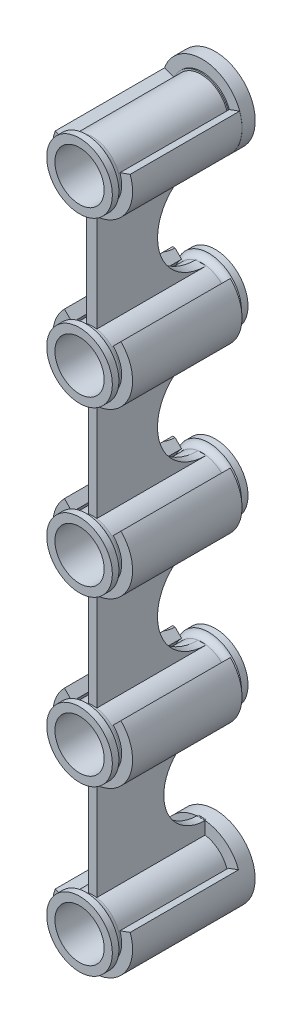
ISO-10303-21;
HEADER;
FILE_DESCRIPTION(('STEP AP214'),'2;1');
FILE_NAME('part.step','',(''),(''),'','','');
FILE_SCHEMA(('AUTOMOTIVE_DESIGN { 1 0 10303 214 1 1 1 1 }'));
ENDSEC;
DATA;
#1=APPLICATION_CONTEXT('core data for automotive mechanical design processes');
#2=APPLICATION_PROTOCOL_DEFINITION('international standard','automotive_design',2000,#1);
#3=PRODUCT_CONTEXT('',#1,'mechanical');
#4=PRODUCT('Part','Part','',(#3));
#5=PRODUCT_RELATED_PRODUCT_CATEGORY('part','',(#4));
#6=PRODUCT_DEFINITION_FORMATION('','',#4);
#7=PRODUCT_DEFINITION_CONTEXT('part definition',#1,'design');
#8=PRODUCT_DEFINITION('design','',#6,#7);
#9=PRODUCT_DEFINITION_SHAPE('','',#8);
#10=(LENGTH_UNIT() NAMED_UNIT(*) SI_UNIT(.MILLI.,.METRE.));
#11=(NAMED_UNIT(*) PLANE_ANGLE_UNIT() SI_UNIT($,.RADIAN.));
#12=(NAMED_UNIT(*) SI_UNIT($,.STERADIAN.) SOLID_ANGLE_UNIT());
#13=UNCERTAINTY_MEASURE_WITH_UNIT(LENGTH_MEASURE(1.E-05),#10,'distance_accuracy_value','');
#14=(GEOMETRIC_REPRESENTATION_CONTEXT(3) GLOBAL_UNCERTAINTY_ASSIGNED_CONTEXT((#13)) GLOBAL_UNIT_ASSIGNED_CONTEXT((#10,
#11,#12)) REPRESENTATION_CONTEXT('',''));
#15=CARTESIAN_POINT('',(0.,0.,0.));
#16=DIRECTION('',(0.,0.,1.));
#17=DIRECTION('',(1.,0.,0.));
#18=AXIS2_PLACEMENT_3D('',#15,#16,#17);
#19=CARTESIAN_POINT('',(0.,0.,0.));
#20=DIRECTION('',(0.,0.,1.));
#21=DIRECTION('',(1.,0.,0.));
#22=AXIS2_PLACEMENT_3D('',#19,#20,#21);
#23=PLANE('',#22);
#24=DIRECTION('',(1.,0.,0.));
#25=VECTOR('',#24,1.);
#26=CARTESIAN_POINT('',(-21.45,94.9434299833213,0.));
#27=LINE('',#26,#25);
#28=CARTESIAN_POINT('',(-1.17098087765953,94.9434299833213,0.));
#29=VERTEX_POINT('',#28);
#30=CARTESIAN_POINT('',(-0.749999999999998,94.9434299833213,0.));
#31=VERTEX_POINT('',#30);
#32=EDGE_CURVE('E358',#29,#31,#27,.T.);
#33=ORIENTED_EDGE('',*,*,#32,.T.);
#34=CARTESIAN_POINT('',(0.,90.,0.));
#35=DIRECTION('',(0.,0.,-1.));
#36=DIRECTION('',(-1.,0.,0.));
#37=AXIS2_PLACEMENT_3D('',#34,#35,#36);
#38=CIRCLE('',#37,5.);
#39=CARTESIAN_POINT('',(-1.17098087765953,94.8609467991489,0.));
#40=VERTEX_POINT('',#39);
#41=EDGE_CURVE('E375',#40,#31,#38,.T.);
#42=ORIENTED_EDGE('',*,*,#41,.F.);
#43=DIRECTION('',(0.,1.,0.));
#44=VECTOR('',#43,1.);
#45=CARTESIAN_POINT('',(-1.17098087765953,0.,0.));
#46=LINE('',#45,#44);
#47=EDGE_CURVE('E483',#40,#29,#46,.T.);
#48=ORIENTED_EDGE('',*,*,#47,.T.);
#49=EDGE_LOOP('',(#33,#42,#48));
#50=FACE_BOUND('',#49,.T.);
#51=ADVANCED_FACE('F262',(#50),#23,.F.);
#52=DIRECTION('',(1.,0.,0.));
#53=VECTOR('',#52,1.);
#54=CARTESIAN_POINT('',(-21.45,112.721501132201,0.));
#55=LINE('',#54,#53);
#56=CARTESIAN_POINT('',(-1.17098087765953,112.721501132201,0.));
#57=VERTEX_POINT('',#56);
#58=CARTESIAN_POINT('',(-0.750000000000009,112.721501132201,0.));
#59=VERTEX_POINT('',#58);
#60=EDGE_CURVE('E277',#57,#59,#55,.T.);
#61=ORIENTED_EDGE('',*,*,#60,.F.);
#62=CARTESIAN_POINT('',(-1.17098087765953,112.777268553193,0.));
#63=VERTEX_POINT('',#62);
#64=EDGE_CURVE('E284',#57,#63,#46,.T.);
#65=ORIENTED_EDGE('',*,*,#64,.T.);
#66=CARTESIAN_POINT('',(0.,120.,0.));
#67=DIRECTION('',(0.,0.,-1.));
#68=DIRECTION('',(-1.,0.,0.));
#69=AXIS2_PLACEMENT_3D('',#66,#67,#68);
#70=CIRCLE('',#69,7.31703804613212);
#71=EDGE_CURVE('E581',#59,#63,#70,.T.);
#72=ORIENTED_EDGE('',*,*,#71,.F.);
#73=EDGE_LOOP('',(#61,#65,#72));
#74=FACE_BOUND('',#73,.T.);
#75=ADVANCED_FACE('F423',(#74),#23,.F.);
#76=CARTESIAN_POINT('',(0.75,0.,20.));
#77=DIRECTION('',(-1.,0.,0.));
#78=DIRECTION('',(0.,0.,1.));
#79=AXIS2_PLACEMENT_3D('',#76,#77,#78);
#80=PLANE('',#79);
#81=CARTESIAN_POINT('',(0.75,103.832465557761,0.));
#82=DIRECTION('',(1.,0.,0.));
#83=DIRECTION('',(0.,0.,-1.));
#84=AXIS2_PLACEMENT_3D('',#81,#82,#83);
#85=CIRCLE('',#84,8.88903557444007);
#86=CARTESIAN_POINT('',(0.75,94.9434299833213,0.));
#87=VERTEX_POINT('',#86);
#88=CARTESIAN_POINT('',(0.75,112.721501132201,0.));
#89=VERTEX_POINT('',#88);
#90=EDGE_CURVE('E359',#87,#89,#85,.F.);
#91=ORIENTED_EDGE('',*,*,#90,.T.);
#92=DIRECTION('',(0.,-1.,0.));
#93=VECTOR('',#92,1.);
#94=CARTESIAN_POINT('',(0.75,0.,0.));
#95=LINE('',#94,#93);
#96=CARTESIAN_POINT('',(0.75,112.738629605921,0.));
#97=VERTEX_POINT('',#96);
#98=EDGE_CURVE('E571',#97,#89,#95,.T.);
#99=ORIENTED_EDGE('',*,*,#98,.F.);
#100=DIRECTION('',(0.,0.,-1.));
#101=VECTOR('',#100,1.);
#102=CARTESIAN_POINT('',(0.75,112.738629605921,20.));
#103=LINE('',#102,#101);
#104=CARTESIAN_POINT('',(0.75,112.738629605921,20.));
#105=VERTEX_POINT('',#104);
#106=EDGE_CURVE('E384',#105,#97,#103,.T.);
#107=ORIENTED_EDGE('',*,*,#106,.F.);
#108=DIRECTION('',(0.,1.,0.));
#109=VECTOR('',#108,1.);
#110=CARTESIAN_POINT('',(0.75,0.,20.));
#111=LINE('',#110,#109);
#112=CARTESIAN_POINT('',(0.75,94.9434299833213,20.));
#113=VERTEX_POINT('',#112);
#114=EDGE_CURVE('E381',#113,#105,#111,.T.);
#115=ORIENTED_EDGE('',*,*,#114,.F.);
#116=DIRECTION('',(0.,0.,-1.));
#117=VECTOR('',#116,1.);
#118=CARTESIAN_POINT('',(0.75,94.9434299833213,20.));
#119=LINE('',#118,#117);
#120=EDGE_CURVE('E373',#113,#87,#119,.T.);
#121=ORIENTED_EDGE('',*,*,#120,.T.);
#122=EDGE_LOOP('',(#91,#99,#107,#115,#121));
#123=FACE_BOUND('',#122,.T.);
#124=ADVANCED_FACE('F379',(#123),#80,.F.);
#125=CARTESIAN_POINT('',(-1.17098087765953,0.,20.));
#126=DIRECTION('',(-1.,0.,0.));
#127=DIRECTION('',(0.,0.,1.));
#128=AXIS2_PLACEMENT_3D('',#125,#126,#127);
#129=PLANE('',#128);
#130=ORIENTED_EDGE('',*,*,#64,.F.);
#131=CARTESIAN_POINT('',(-1.17098087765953,103.832465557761,0.));
#132=DIRECTION('',(-1.,0.,0.));
#133=DIRECTION('',(0.,0.,1.));
#134=AXIS2_PLACEMENT_3D('',#131,#132,#133);
#135=CIRCLE('',#134,8.88903557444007);
#136=EDGE_CURVE('E377',#57,#29,#135,.F.);
#137=ORIENTED_EDGE('',*,*,#136,.T.);
#138=ORIENTED_EDGE('',*,*,#47,.F.);
#139=DIRECTION('',(0.,0.,-1.));
#140=VECTOR('',#139,1.);
#141=CARTESIAN_POINT('',(-1.17098087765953,94.8609467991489,20.));
#142=LINE('',#141,#140);
#143=CARTESIAN_POINT('',(-1.17098087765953,94.8609467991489,20.));
#144=VERTEX_POINT('',#143);
#145=EDGE_CURVE('E497',#144,#40,#142,.T.);
#146=ORIENTED_EDGE('',*,*,#145,.F.);
#147=DIRECTION('',(0.,1.,0.));
#148=VECTOR('',#147,1.);
#149=CARTESIAN_POINT('',(-1.17098087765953,0.,20.));
#150=LINE('',#149,#148);
#151=CARTESIAN_POINT('',(-1.17098087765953,112.794529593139,20.));
#152=VERTEX_POINT('',#151);
#153=EDGE_CURVE('E494',#144,#152,#150,.T.);
#154=ORIENTED_EDGE('',*,*,#153,.T.);
#155=DIRECTION('',(0.,0.,-1.));
#156=VECTOR('',#155,1.);
#157=CARTESIAN_POINT('',(-1.17098087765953,112.794529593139,20.));
#158=LINE('',#157,#156);
#159=CARTESIAN_POINT('',(-1.17098087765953,112.794529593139,0.));
#160=VERTEX_POINT('',#159);
#161=EDGE_CURVE('E509',#152,#160,#158,.T.);
#162=ORIENTED_EDGE('',*,*,#161,.T.);
#163=DIRECTION('',(0.,-1.,0.));
#164=VECTOR('',#163,1.);
#165=CARTESIAN_POINT('',(-1.17098087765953,0.,0.));
#166=LINE('',#165,#164);
#167=EDGE_CURVE('E574',#160,#63,#166,.T.);
#168=ORIENTED_EDGE('',*,*,#167,.T.);
#169=EDGE_LOOP('',(#130,#137,#138,#146,#154,#162,#168));
#170=FACE_BOUND('',#169,.T.);
#171=ADVANCED_FACE('F403',(#170),#129,.T.);
#172=CARTESIAN_POINT('',(0.,120.,0.2));
#173=DIRECTION('',(0.,0.,-1.));
#174=DIRECTION('',(-1.,0.,0.));
#175=AXIS2_PLACEMENT_3D('',#172,#173,#174);
#176=PLANE('',#175);
#177=CARTESIAN_POINT('',(0.,120.,0.2));
#178=DIRECTION('',(0.,0.,-1.));
#179=DIRECTION('',(-1.,0.,0.));
#180=AXIS2_PLACEMENT_3D('',#177,#178,#179);
#181=CIRCLE('',#180,5.3);
#182=CARTESIAN_POINT('',(-4.98037089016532,121.812706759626,0.2));
#183=VERTEX_POINT('',#182);
#184=CARTESIAN_POINT('',(4.98037089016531,121.812706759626,0.2));
#185=VERTEX_POINT('',#184);
#186=EDGE_CURVE('E539',#183,#185,#181,.T.);
#187=ORIENTED_EDGE('',*,*,#186,.F.);
#188=EDGE_CURVE('E535',#185,#183,#181,.T.);
#189=ORIENTED_EDGE('',*,*,#188,.F.);
#190=EDGE_LOOP('',(#187,#189));
#191=FACE_BOUND('',#190,.T.);
#192=CARTESIAN_POINT('',(0.,120.,0.199999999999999));
#193=DIRECTION('',(0.,0.,-1.));
#194=DIRECTION('',(-1.,0.,0.));
#195=AXIS2_PLACEMENT_3D('',#192,#193,#194);
#196=CIRCLE('',#195,5.);
#197=CARTESIAN_POINT('',(-5.,120.,0.199999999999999));
#198=VERTEX_POINT('',#197);
#199=EDGE_CURVE('E270',#198,#198,#196,.F.);
#200=ORIENTED_EDGE('',*,*,#199,.F.);
#201=EDGE_LOOP('',(#200));
#202=FACE_BOUND('',#201,.T.);
#203=ADVANCED_FACE('F400',(#191,#202),#176,.F.);
#204=CARTESIAN_POINT('',(0.,120.,20.));
#205=DIRECTION('',(0.,0.,-1.));
#206=DIRECTION('',(-1.,0.,0.));
#207=AXIS2_PLACEMENT_3D('',#204,#205,#206);
#208=CYLINDRICAL_SURFACE('',#207,5.3);
#209=DIRECTION('',(0.,0.,-1.));
#210=VECTOR('',#209,1.);
#211=CARTESIAN_POINT('',(4.98037089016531,121.812706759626,20.));
#212=LINE('',#211,#210);
#213=CARTESIAN_POINT('',(4.98037089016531,121.812706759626,20.));
#214=VERTEX_POINT('',#213);
#215=EDGE_CURVE('E517',#214,#185,#212,.T.);
#216=ORIENTED_EDGE('',*,*,#215,.T.);
#217=ORIENTED_EDGE('',*,*,#188,.T.);
#218=DIRECTION('',(0.,0.,-1.));
#219=VECTOR('',#218,1.);
#220=CARTESIAN_POINT('',(-4.98037089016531,121.812706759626,20.));
#221=LINE('',#220,#219);
#222=CARTESIAN_POINT('',(-4.98037089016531,121.812706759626,20.));
#223=VERTEX_POINT('',#222);
#224=EDGE_CURVE('E514',#223,#183,#221,.T.);
#225=ORIENTED_EDGE('',*,*,#224,.F.);
#226=CARTESIAN_POINT('',(0.,120.,20.));
#227=DIRECTION('',(0.,0.,1.));
#228=DIRECTION('',(1.,0.,0.));
#229=AXIS2_PLACEMENT_3D('',#226,#227,#228);
#230=CIRCLE('',#229,5.3);
#231=EDGE_CURVE('E489',#223,#214,#230,.T.);
#232=ORIENTED_EDGE('',*,*,#231,.T.);
#233=EDGE_LOOP('',(#216,#217,#225,#232));
#234=FACE_BOUND('',#233,.T.);
#235=ADVANCED_FACE('F402',(#234),#208,.F.);
#236=CARTESIAN_POINT('',(0.,90.,20.));
#237=DIRECTION('',(0.,0.,-1.));
#238=DIRECTION('',(-1.,0.,0.));
#239=AXIS2_PLACEMENT_3D('',#236,#237,#238);
#240=CYLINDRICAL_SURFACE('',#239,5.);
#241=CARTESIAN_POINT('',(0.,90.,-0.0167840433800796));
#242=DIRECTION('',(0.,0.,-1.));
#243=DIRECTION('',(-1.,0.,0.));
#244=AXIS2_PLACEMENT_3D('',#241,#242,#243);
#245=CIRCLE('',#244,5.);
#246=CARTESIAN_POINT('',(-5.,90.,-0.0167840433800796));
#247=VERTEX_POINT('',#246);
#248=EDGE_CURVE('E13',#247,#247,#245,.F.);
#249=ORIENTED_EDGE('',*,*,#248,.T.);
#250=EDGE_LOOP('',(#249));
#251=FACE_BOUND('',#250,.T.);
#252=CARTESIAN_POINT('',(0.,90.,20.0167840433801));
#253=DIRECTION('',(0.,0.,1.));
#254=DIRECTION('',(1.,0.,0.));
#255=AXIS2_PLACEMENT_3D('',#252,#253,#254);
#256=CIRCLE('',#255,5.);
#257=CARTESIAN_POINT('',(5.,90.,20.0167840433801));
#258=VERTEX_POINT('',#257);
#259=EDGE_CURVE('E383',#258,#258,#256,.F.);
#260=ORIENTED_EDGE('',*,*,#259,.T.);
#261=EDGE_LOOP('',(#260));
#262=FACE_BOUND('',#261,.T.);
#263=ORIENTED_EDGE('',*,*,#145,.T.);
#264=ORIENTED_EDGE('',*,*,#41,.T.);
#265=CARTESIAN_POINT('',(0.,90.,0.));
#266=DIRECTION('',(0.,0.,-1.));
#267=DIRECTION('',(-1.,0.,0.));
#268=AXIS2_PLACEMENT_3D('',#265,#266,#267);
#269=CIRCLE('',#268,5.);
#270=EDGE_CURVE('E356',#31,#87,#269,.T.);
#271=ORIENTED_EDGE('',*,*,#270,.T.);
#272=ORIENTED_EDGE('',*,*,#120,.F.);
#273=CARTESIAN_POINT('',(0.,90.,20.));
#274=DIRECTION('',(0.,0.,1.));
#275=DIRECTION('',(1.,0.,0.));
#276=AXIS2_PLACEMENT_3D('',#273,#274,#275);
#277=CIRCLE('',#276,5.);
#278=EDGE_CURVE('E470',#113,#144,#277,.T.);
#279=ORIENTED_EDGE('',*,*,#278,.T.);
#280=EDGE_LOOP('',(#263,#264,#271,#272,#279));
#281=FACE_BOUND('',#280,.T.);
#282=ADVANCED_FACE('F371',(#251,#262,#281),#240,.T.);
#283=CARTESIAN_POINT('',(0.,120.,20.));
#284=DIRECTION('',(0.,0.,-1.));
#285=DIRECTION('',(-1.,0.,0.));
#286=AXIS2_PLACEMENT_3D('',#283,#284,#285);
#287=CYLINDRICAL_SURFACE('',#286,7.3);
#288=CARTESIAN_POINT('',(0.,120.,0.));
#289=DIRECTION('',(0.,0.,1.));
#290=DIRECTION('',(1.,0.,0.));
#291=AXIS2_PLACEMENT_3D('',#288,#289,#290);
#292=CIRCLE('',#291,7.3);
#293=CARTESIAN_POINT('',(6.85975613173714,122.496747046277,0.));
#294=VERTEX_POINT('',#293);
#295=EDGE_CURVE('E473',#97,#294,#292,.T.);
#296=ORIENTED_EDGE('',*,*,#295,.T.);
#297=DIRECTION('',(0.,0.,-1.));
#298=VECTOR('',#297,1.);
#299=CARTESIAN_POINT('',(6.85975613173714,122.496747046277,20.));
#300=LINE('',#299,#298);
#301=CARTESIAN_POINT('',(6.85975613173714,122.496747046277,20.));
#302=VERTEX_POINT('',#301);
#303=EDGE_CURVE('E390',#302,#294,#300,.T.);
#304=ORIENTED_EDGE('',*,*,#303,.F.);
#305=CARTESIAN_POINT('',(0.,120.,20.));
#306=DIRECTION('',(0.,0.,1.));
#307=DIRECTION('',(1.,0.,0.));
#308=AXIS2_PLACEMENT_3D('',#305,#306,#307);
#309=CIRCLE('',#308,7.3);
#310=EDGE_CURVE('E482',#105,#302,#309,.T.);
#311=ORIENTED_EDGE('',*,*,#310,.F.);
#312=ORIENTED_EDGE('',*,*,#106,.T.);
#313=EDGE_LOOP('',(#296,#304,#311,#312));
#314=FACE_BOUND('',#313,.T.);
#315=ADVANCED_FACE('F438',(#314),#287,.T.);
#316=CARTESIAN_POINT('',(-38.5672565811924,105.962666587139,20.));
#317=DIRECTION('',(-0.342020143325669,0.939692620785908,0.));
#318=DIRECTION('',(-0.939692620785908,-0.342020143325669,0.));
#319=AXIS2_PLACEMENT_3D('',#316,#317,#318);
#320=PLANE('',#319);
#321=DIRECTION('',(0.939692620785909,0.342020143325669,0.));
#322=VECTOR('',#321,1.);
#323=CARTESIAN_POINT('',(-38.5672565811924,105.962666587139,0.));
#324=LINE('',#323,#322);
#325=CARTESIAN_POINT('',(4.98037089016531,121.812706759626,0.));
#326=VERTEX_POINT('',#325);
#327=EDGE_CURVE('E500',#326,#294,#324,.T.);
#328=ORIENTED_EDGE('',*,*,#327,.F.);
#329=DIRECTION('',(0.,0.,-1.));
#330=VECTOR('',#329,1.);
#331=CARTESIAN_POINT('',(4.98037089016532,121.812706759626,0.2));
#332=LINE('',#331,#330);
#333=EDGE_CURVE('E546',#185,#326,#332,.T.);
#334=ORIENTED_EDGE('',*,*,#333,.F.);
#335=ORIENTED_EDGE('',*,*,#215,.F.);
#336=DIRECTION('',(0.939692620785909,0.342020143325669,0.));
#337=VECTOR('',#336,1.);
#338=CARTESIAN_POINT('',(-38.5672565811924,105.962666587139,20.));
#339=LINE('',#338,#337);
#340=EDGE_CURVE('E485',#214,#302,#339,.T.);
#341=ORIENTED_EDGE('',*,*,#340,.T.);
#342=ORIENTED_EDGE('',*,*,#303,.T.);
#343=EDGE_LOOP('',(#328,#334,#335,#341,#342));
#344=FACE_BOUND('',#343,.T.);
#345=ADVANCED_FACE('F440',(#344),#320,.T.);
#346=CARTESIAN_POINT('',(38.5672565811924,105.962666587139,20.));
#347=DIRECTION('',(-0.342020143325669,-0.939692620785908,0.));
#348=DIRECTION('',(0.939692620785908,-0.342020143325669,0.));
#349=AXIS2_PLACEMENT_3D('',#346,#347,#348);
#350=PLANE('',#349);
#351=DIRECTION('',(-0.939692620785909,0.342020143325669,0.));
#352=VECTOR('',#351,1.);
#353=CARTESIAN_POINT('',(38.5672565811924,105.962666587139,0.));
#354=LINE('',#353,#352);
#355=CARTESIAN_POINT('',(-4.98037089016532,121.812706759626,0.));
#356=VERTEX_POINT('',#355);
#357=CARTESIAN_POINT('',(-6.85975613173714,122.496747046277,0.));
#358=VERTEX_POINT('',#357);
#359=EDGE_CURVE('E504',#356,#358,#354,.T.);
#360=ORIENTED_EDGE('',*,*,#359,.T.);
#361=DIRECTION('',(0.,0.,-1.));
#362=VECTOR('',#361,1.);
#363=CARTESIAN_POINT('',(-6.85975613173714,122.496747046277,20.));
#364=LINE('',#363,#362);
#365=CARTESIAN_POINT('',(-6.85975613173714,122.496747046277,20.));
#366=VERTEX_POINT('',#365);
#367=EDGE_CURVE('E511',#366,#358,#364,.T.);
#368=ORIENTED_EDGE('',*,*,#367,.F.);
#369=DIRECTION('',(-0.939692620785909,0.342020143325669,0.));
#370=VECTOR('',#369,1.);
#371=CARTESIAN_POINT('',(38.5672565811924,105.962666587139,20.));
#372=LINE('',#371,#370);
#373=EDGE_CURVE('E492',#223,#366,#372,.T.);
#374=ORIENTED_EDGE('',*,*,#373,.F.);
#375=ORIENTED_EDGE('',*,*,#224,.T.);
#376=DIRECTION('',(0.,0.,-1.));
#377=VECTOR('',#376,1.);
#378=CARTESIAN_POINT('',(-4.98037089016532,121.812706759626,0.2));
#379=LINE('',#378,#377);
#380=EDGE_CURVE('E545',#183,#356,#379,.T.);
#381=ORIENTED_EDGE('',*,*,#380,.T.);
#382=EDGE_LOOP('',(#360,#368,#374,#375,#381));
#383=FACE_BOUND('',#382,.T.);
#384=ADVANCED_FACE('F436',(#383),#350,.F.);
#385=EDGE_CURVE('E501',#358,#160,#292,.T.);
#386=ORIENTED_EDGE('',*,*,#385,.T.);
#387=ORIENTED_EDGE('',*,*,#161,.F.);
#388=EDGE_CURVE('E486',#366,#152,#309,.T.);
#389=ORIENTED_EDGE('',*,*,#388,.F.);
#390=ORIENTED_EDGE('',*,*,#367,.T.);
#391=EDGE_LOOP('',(#386,#387,#389,#390));
#392=FACE_BOUND('',#391,.T.);
#393=ADVANCED_FACE('F433',(#392),#287,.T.);
#394=CARTESIAN_POINT('',(0.,0.,20.));
#395=DIRECTION('',(0.,0.,1.));
#396=DIRECTION('',(1.,0.,0.));
#397=AXIS2_PLACEMENT_3D('',#394,#395,#396);
#398=PLANE('',#397);
#399=ORIENTED_EDGE('',*,*,#278,.F.);
#400=ORIENTED_EDGE('',*,*,#114,.T.);
#401=ORIENTED_EDGE('',*,*,#310,.T.);
#402=ORIENTED_EDGE('',*,*,#340,.F.);
#403=ORIENTED_EDGE('',*,*,#231,.F.);
#404=ORIENTED_EDGE('',*,*,#373,.T.);
#405=ORIENTED_EDGE('',*,*,#388,.T.);
#406=ORIENTED_EDGE('',*,*,#153,.F.);
#407=EDGE_LOOP('',(#399,#400,#401,#402,#403,#404,#405,#406));
#408=FACE_BOUND('',#407,.T.);
#409=ADVANCED_FACE('F430',(#408),#398,.T.);
#410=CARTESIAN_POINT('',(0.,90.,22.4));
#411=DIRECTION('',(0.,0.,-1.));
#412=DIRECTION('',(-1.,0.,0.));
#413=AXIS2_PLACEMENT_3D('',#410,#411,#412);
#414=CYLINDRICAL_SURFACE('',#413,6.);
#415=CARTESIAN_POINT('',(0.,90.,22.4));
#416=DIRECTION('',(0.,0.,1.));
#417=DIRECTION('',(1.,0.,0.));
#418=AXIS2_PLACEMENT_3D('',#415,#416,#417);
#419=CIRCLE('',#418,6.);
#420=CARTESIAN_POINT('',(6.,90.,22.4));
#421=VERTEX_POINT('',#420);
#422=EDGE_CURVE('E471',#421,#421,#419,.T.);
#423=ORIENTED_EDGE('',*,*,#422,.F.);
#424=EDGE_LOOP('',(#423));
#425=FACE_BOUND('',#424,.T.);
#426=CARTESIAN_POINT('',(0.,90.,21.2));
#427=DIRECTION('',(0.,0.,1.));
#428=DIRECTION('',(1.,0.,0.));
#429=AXIS2_PLACEMENT_3D('',#426,#427,#428);
#430=CIRCLE('',#429,6.);
#431=CARTESIAN_POINT('',(6.,90.,21.2));
#432=VERTEX_POINT('',#431);
#433=EDGE_CURVE('E468',#432,#432,#430,.T.);
#434=ORIENTED_EDGE('',*,*,#433,.T.);
#435=EDGE_LOOP('',(#434));
#436=FACE_BOUND('',#435,.T.);
#437=ADVANCED_FACE('F462',(#425,#436),#414,.T.);
#438=CARTESIAN_POINT('',(0.,90.,22.4));
#439=DIRECTION('',(0.,0.,1.));
#440=DIRECTION('',(1.,0.,0.));
#441=AXIS2_PLACEMENT_3D('',#438,#439,#440);
#442=PLANE('',#441);
#443=CARTESIAN_POINT('',(0.,90.,22.4));
#444=DIRECTION('',(0.,0.,1.));
#445=DIRECTION('',(1.,0.,0.));
#446=AXIS2_PLACEMENT_3D('',#443,#444,#445);
#447=CIRCLE('',#446,4.5);
#448=CARTESIAN_POINT('',(4.5,90.,22.4));
#449=VERTEX_POINT('',#448);
#450=EDGE_CURVE('E476',#449,#449,#447,.T.);
#451=ORIENTED_EDGE('',*,*,#450,.F.);
#452=EDGE_LOOP('',(#451));
#453=FACE_BOUND('',#452,.T.);
#454=ORIENTED_EDGE('',*,*,#422,.T.);
#455=EDGE_LOOP('',(#454));
#456=FACE_BOUND('',#455,.T.);
#457=ADVANCED_FACE('F453',(#453,#456),#442,.T.);
#458=CARTESIAN_POINT('',(0.,90.,20.0167840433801));
#459=DIRECTION('',(0.,0.,1.));
#460=DIRECTION('',(1.,0.,0.));
#461=AXIS2_PLACEMENT_3D('',#458,#459,#460);
#462=TOROIDAL_SURFACE('',#461,6.2,1.2);
#463=ORIENTED_EDGE('',*,*,#259,.F.);
#464=EDGE_LOOP('',(#463));
#465=FACE_BOUND('',#464,.T.);
#466=ORIENTED_EDGE('',*,*,#433,.F.);
#467=EDGE_LOOP('',(#466));
#468=FACE_BOUND('',#467,.T.);
#469=ADVANCED_FACE('F450',(#465,#468),#462,.F.);
#470=CARTESIAN_POINT('',(0.,90.,-51.8));
#471=DIRECTION('',(0.,0.,1.));
#472=DIRECTION('',(1.,0.,0.));
#473=AXIS2_PLACEMENT_3D('',#470,#471,#472);
#474=CYLINDRICAL_SURFACE('',#473,4.5);
#475=ORIENTED_EDGE('',*,*,#450,.T.);
#476=EDGE_LOOP('',(#475));
#477=FACE_BOUND('',#476,.T.);
#478=CARTESIAN_POINT('',(0.,90.,-2.4));
#479=DIRECTION('',(0.,0.,-1.));
#480=DIRECTION('',(-1.,0.,0.));
#481=AXIS2_PLACEMENT_3D('',#478,#479,#480);
#482=CIRCLE('',#481,4.5);
#483=CARTESIAN_POINT('',(-4.5,90.,-2.4));
#484=VERTEX_POINT('',#483);
#485=EDGE_CURVE('E589',#484,#484,#482,.T.);
#486=ORIENTED_EDGE('',*,*,#485,.T.);
#487=EDGE_LOOP('',(#486));
#488=FACE_BOUND('',#487,.T.);
#489=ADVANCED_FACE('F452',(#477,#488),#474,.F.);
#490=CARTESIAN_POINT('',(0.,120.,0.2));
#491=DIRECTION('',(0.,0.,-1.));
#492=DIRECTION('',(-1.,0.,0.));
#493=AXIS2_PLACEMENT_3D('',#490,#491,#492);
#494=CYLINDRICAL_SURFACE('',#493,5.3);
#495=ORIENTED_EDGE('',*,*,#186,.T.);
#496=ORIENTED_EDGE('',*,*,#333,.T.);
#497=CARTESIAN_POINT('',(0.,120.,0.));
#498=DIRECTION('',(0.,0.,-1.));
#499=DIRECTION('',(-1.,0.,0.));
#500=AXIS2_PLACEMENT_3D('',#497,#498,#499);
#501=CIRCLE('',#500,5.3);
#502=EDGE_CURVE('E531',#356,#326,#501,.T.);
#503=ORIENTED_EDGE('',*,*,#502,.F.);
#504=ORIENTED_EDGE('',*,*,#380,.F.);
#505=EDGE_LOOP('',(#495,#496,#503,#504));
#506=FACE_BOUND('',#505,.T.);
#507=ADVANCED_FACE('F459',(#506),#494,.T.);
#508=CARTESIAN_POINT('',(0.,120.,20.));
#509=DIRECTION('',(0.,0.,-1.));
#510=DIRECTION('',(-1.,0.,0.));
#511=AXIS2_PLACEMENT_3D('',#508,#509,#510);
#512=CYLINDRICAL_SURFACE('',#511,5.);
#513=CARTESIAN_POINT('',(0.,120.,20.0167840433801));
#514=DIRECTION('',(0.,0.,1.));
#515=DIRECTION('',(1.,0.,0.));
#516=AXIS2_PLACEMENT_3D('',#513,#514,#515);
#517=CIRCLE('',#516,5.);
#518=CARTESIAN_POINT('',(5.,120.,20.0167840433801));
#519=VERTEX_POINT('',#518);
#520=EDGE_CURVE('E536',#519,#519,#517,.F.);
#521=ORIENTED_EDGE('',*,*,#520,.T.);
#522=EDGE_LOOP('',(#521));
#523=FACE_BOUND('',#522,.T.);
#524=ORIENTED_EDGE('',*,*,#199,.T.);
#525=EDGE_LOOP('',(#524));
#526=FACE_BOUND('',#525,.T.);
#527=ADVANCED_FACE('F398',(#523,#526),#512,.T.);
#528=CARTESIAN_POINT('',(0.,120.,-51.8));
#529=DIRECTION('',(0.,0.,1.));
#530=DIRECTION('',(1.,0.,0.));
#531=AXIS2_PLACEMENT_3D('',#528,#529,#530);
#532=CYLINDRICAL_SURFACE('',#531,4.5);
#533=CARTESIAN_POINT('',(0.,120.,22.4));
#534=DIRECTION('',(0.,0.,1.));
#535=DIRECTION('',(1.,0.,0.));
#536=AXIS2_PLACEMENT_3D('',#533,#534,#535);
#537=CIRCLE('',#536,4.5);
#538=CARTESIAN_POINT('',(4.5,120.,22.4));
#539=VERTEX_POINT('',#538);
#540=EDGE_CURVE('E595',#539,#539,#537,.T.);
#541=ORIENTED_EDGE('',*,*,#540,.T.);
#542=EDGE_LOOP('',(#541));
#543=FACE_BOUND('',#542,.T.);
#544=CARTESIAN_POINT('',(0.,120.,0.199999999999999));
#545=DIRECTION('',(0.,0.,-1.));
#546=DIRECTION('',(-1.,0.,0.));
#547=AXIS2_PLACEMENT_3D('',#544,#545,#546);
#548=CIRCLE('',#547,4.5);
#549=CARTESIAN_POINT('',(-4.5,120.,0.199999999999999));
#550=VERTEX_POINT('',#549);
#551=EDGE_CURVE('E387',#550,#550,#548,.T.);
#552=ORIENTED_EDGE('',*,*,#551,.T.);
#553=EDGE_LOOP('',(#552));
#554=FACE_BOUND('',#553,.T.);
#555=ADVANCED_FACE('F564',(#543,#554),#532,.F.);
#556=CARTESIAN_POINT('',(0.,120.,22.4));
#557=DIRECTION('',(0.,0.,-1.));
#558=DIRECTION('',(-1.,0.,0.));
#559=AXIS2_PLACEMENT_3D('',#556,#557,#558);
#560=CYLINDRICAL_SURFACE('',#559,6.);
#561=CARTESIAN_POINT('',(0.,120.,22.4));
#562=DIRECTION('',(0.,0.,1.));
#563=DIRECTION('',(1.,0.,0.));
#564=AXIS2_PLACEMENT_3D('',#561,#562,#563);
#565=CIRCLE('',#564,6.);
#566=CARTESIAN_POINT('',(6.,120.,22.4));
#567=VERTEX_POINT('',#566);
#568=EDGE_CURVE('E598',#567,#567,#565,.T.);
#569=ORIENTED_EDGE('',*,*,#568,.F.);
#570=EDGE_LOOP('',(#569));
#571=FACE_BOUND('',#570,.T.);
#572=CARTESIAN_POINT('',(0.,120.,21.2));
#573=DIRECTION('',(0.,0.,1.));
#574=DIRECTION('',(1.,0.,0.));
#575=AXIS2_PLACEMENT_3D('',#572,#573,#574);
#576=CIRCLE('',#575,6.);
#577=CARTESIAN_POINT('',(6.,120.,21.2));
#578=VERTEX_POINT('',#577);
#579=EDGE_CURVE('E542',#578,#578,#576,.T.);
#580=ORIENTED_EDGE('',*,*,#579,.T.);
#581=EDGE_LOOP('',(#580));
#582=FACE_BOUND('',#581,.T.);
#583=ADVANCED_FACE('F606',(#571,#582),#560,.T.);
#584=CARTESIAN_POINT('',(0.,120.,22.4));
#585=DIRECTION('',(0.,0.,1.));
#586=DIRECTION('',(1.,0.,0.));
#587=AXIS2_PLACEMENT_3D('',#584,#585,#586);
#588=PLANE('',#587);
#589=ORIENTED_EDGE('',*,*,#540,.F.);
#590=EDGE_LOOP('',(#589));
#591=FACE_BOUND('',#590,.T.);
#592=ORIENTED_EDGE('',*,*,#568,.T.);
#593=EDGE_LOOP('',(#592));
#594=FACE_BOUND('',#593,.T.);
#595=ADVANCED_FACE('F604',(#591,#594),#588,.T.);
#596=CARTESIAN_POINT('',(0.,120.,20.0167840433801));
#597=DIRECTION('',(0.,0.,1.));
#598=DIRECTION('',(1.,0.,0.));
#599=AXIS2_PLACEMENT_3D('',#596,#597,#598);
#600=TOROIDAL_SURFACE('',#599,6.2,1.2);
#601=ORIENTED_EDGE('',*,*,#520,.F.);
#602=EDGE_LOOP('',(#601));
#603=FACE_BOUND('',#602,.T.);
#604=ORIENTED_EDGE('',*,*,#579,.F.);
#605=EDGE_LOOP('',(#604));
#606=FACE_BOUND('',#605,.T.);
#607=ADVANCED_FACE('F420',(#603,#606),#600,.F.);
#608=ORIENTED_EDGE('',*,*,#551,.F.);
#609=EDGE_LOOP('',(#608));
#610=FACE_BOUND('',#609,.T.);
#611=ADVANCED_FACE('F406',(#610),#176,.F.);
#612=CARTESIAN_POINT('',(0.,90.,-2.4));
#613=DIRECTION('',(0.,0.,-1.));
#614=DIRECTION('',(-1.,0.,0.));
#615=AXIS2_PLACEMENT_3D('',#612,#613,#614);
#616=PLANE('',#615);
#617=CARTESIAN_POINT('',(0.,90.,-2.4));
#618=DIRECTION('',(0.,0.,-1.));
#619=DIRECTION('',(-1.,0.,0.));
#620=AXIS2_PLACEMENT_3D('',#617,#618,#619);
#621=CIRCLE('',#620,5.99999999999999);
#622=CARTESIAN_POINT('',(-5.99999999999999,90.,-2.4));
#623=VERTEX_POINT('',#622);
#624=EDGE_CURVE('E578',#623,#623,#621,.T.);
#625=ORIENTED_EDGE('',*,*,#624,.T.);
#626=EDGE_LOOP('',(#625));
#627=FACE_BOUND('',#626,.T.);
#628=ORIENTED_EDGE('',*,*,#485,.F.);
#629=EDGE_LOOP('',(#628));
#630=FACE_BOUND('',#629,.T.);
#631=ADVANCED_FACE('F419',(#627,#630),#616,.T.);
#632=CARTESIAN_POINT('',(0.,90.,-2.4));
#633=DIRECTION('',(0.,0.,1.));
#634=DIRECTION('',(1.,0.,0.));
#635=AXIS2_PLACEMENT_3D('',#632,#633,#634);
#636=CYLINDRICAL_SURFACE('',#635,5.99999999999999);
#637=ORIENTED_EDGE('',*,*,#624,.F.);
#638=EDGE_LOOP('',(#637));
#639=FACE_BOUND('',#638,.T.);
#640=CARTESIAN_POINT('',(0.,90.,-1.2));
#641=DIRECTION('',(0.,0.,-1.));
#642=DIRECTION('',(-1.,0.,0.));
#643=AXIS2_PLACEMENT_3D('',#640,#641,#642);
#644=CIRCLE('',#643,5.99999999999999);
#645=CARTESIAN_POINT('',(-5.99999999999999,90.,-1.2));
#646=VERTEX_POINT('',#645);
#647=EDGE_CURVE('E586',#646,#646,#644,.T.);
#648=ORIENTED_EDGE('',*,*,#647,.T.);
#649=EDGE_LOOP('',(#648));
#650=FACE_BOUND('',#649,.T.);
#651=ADVANCED_FACE('F626',(#639,#650),#636,.T.);
#652=CARTESIAN_POINT('',(0.,90.,-0.0167840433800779));
#653=DIRECTION('',(0.,0.,-1.));
#654=DIRECTION('',(-1.,0.,0.));
#655=AXIS2_PLACEMENT_3D('',#652,#653,#654);
#656=TOROIDAL_SURFACE('',#655,6.2,1.2);
#657=ORIENTED_EDGE('',*,*,#248,.F.);
#658=EDGE_LOOP('',(#657));
#659=FACE_BOUND('',#658,.T.);
#660=ORIENTED_EDGE('',*,*,#647,.F.);
#661=EDGE_LOOP('',(#660));
#662=FACE_BOUND('',#661,.T.);
#663=ADVANCED_FACE('F264',(#659,#662),#656,.F.);
#664=CARTESIAN_POINT('',(0.,120.,-23.09570888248));
#665=DIRECTION('',(0.,0.,1.));
#666=DIRECTION('',(1.,0.,0.));
#667=AXIS2_PLACEMENT_3D('',#664,#665,#666);
#668=CYLINDRICAL_SURFACE('',#667,7.31703804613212);
#669=EDGE_CURVE('E575',#89,#59,#70,.T.);
#670=ORIENTED_EDGE('',*,*,#669,.T.);
#671=ORIENTED_EDGE('',*,*,#71,.T.);
#672=EDGE_CURVE('E583',#63,#89,#70,.T.);
#673=ORIENTED_EDGE('',*,*,#672,.T.);
#674=EDGE_LOOP('',(#670,#671,#673));
#675=FACE_BOUND('',#674,.T.);
#676=CARTESIAN_POINT('',(0.,120.,-2.4));
#677=DIRECTION('',(0.,0.,-1.));
#678=DIRECTION('',(-1.,0.,0.));
#679=AXIS2_PLACEMENT_3D('',#676,#677,#678);
#680=CIRCLE('',#679,7.31703804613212);
#681=CARTESIAN_POINT('',(-7.31703804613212,120.,-2.4));
#682=VERTEX_POINT('',#681);
#683=EDGE_CURVE('E376',#682,#682,#680,.T.);
#684=ORIENTED_EDGE('',*,*,#683,.F.);
#685=EDGE_LOOP('',(#684));
#686=FACE_BOUND('',#685,.T.);
#687=ADVANCED_FACE('F634',(#675,#686),#668,.T.);
#688=CARTESIAN_POINT('',(0.,120.,0.));
#689=DIRECTION('',(0.,0.,-1.));
#690=DIRECTION('',(-1.,0.,0.));
#691=AXIS2_PLACEMENT_3D('',#688,#689,#690);
#692=PLANE('',#691);
#693=ORIENTED_EDGE('',*,*,#167,.F.);
#694=ORIENTED_EDGE('',*,*,#385,.F.);
#695=ORIENTED_EDGE('',*,*,#359,.F.);
#696=ORIENTED_EDGE('',*,*,#502,.T.);
#697=ORIENTED_EDGE('',*,*,#327,.T.);
#698=ORIENTED_EDGE('',*,*,#295,.F.);
#699=ORIENTED_EDGE('',*,*,#98,.T.);
#700=ORIENTED_EDGE('',*,*,#672,.F.);
#701=EDGE_LOOP('',(#693,#694,#695,#696,#697,#698,#699,#700));
#702=FACE_BOUND('',#701,.T.);
#703=ADVANCED_FACE('F529',(#702),#692,.F.);
#704=CARTESIAN_POINT('',(0.,30.,-2.4));
#705=DIRECTION('',(0.,0.,-1.));
#706=DIRECTION('',(-1.,0.,0.));
#707=AXIS2_PLACEMENT_3D('',#704,#705,#706);
#708=PLANE('',#707);
#709=ORIENTED_EDGE('',*,*,#683,.T.);
#710=EDGE_LOOP('',(#709));
#711=FACE_BOUND('',#710,.T.);
#712=ADVANCED_FACE('F633',(#711),#708,.T.);
#713=CARTESIAN_POINT('',(-21.45,0.,0.));
#714=DIRECTION('',(0.,0.,-1.));
#715=DIRECTION('',(-1.,0.,0.));
#716=AXIS2_PLACEMENT_3D('',#713,#714,#715);
#717=PLANE('',#716);
#718=EDGE_CURVE('E352',#31,#87,#27,.T.);
#719=ORIENTED_EDGE('',*,*,#718,.T.);
#720=ORIENTED_EDGE('',*,*,#270,.F.);
#721=EDGE_LOOP('',(#719,#720));
#722=FACE_BOUND('',#721,.T.);
#723=ADVANCED_FACE('F354',(#722),#717,.F.);
#724=EDGE_CURVE('E363',#59,#89,#55,.T.);
#725=ORIENTED_EDGE('',*,*,#724,.F.);
#726=ORIENTED_EDGE('',*,*,#669,.F.);
#727=EDGE_LOOP('',(#725,#726));
#728=FACE_BOUND('',#727,.T.);
#729=ADVANCED_FACE('F643',(#728),#717,.F.);
#730=CARTESIAN_POINT('',(-21.45,103.832465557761,0.));
#731=DIRECTION('',(1.,0.,0.));
#732=DIRECTION('',(0.,0.,-1.));
#733=AXIS2_PLACEMENT_3D('',#730,#731,#732);
#734=CYLINDRICAL_SURFACE('',#733,8.88903557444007);
#735=ORIENTED_EDGE('',*,*,#60,.T.);
#736=ORIENTED_EDGE('',*,*,#724,.T.);
#737=ORIENTED_EDGE('',*,*,#90,.F.);
#738=ORIENTED_EDGE('',*,*,#718,.F.);
#739=ORIENTED_EDGE('',*,*,#32,.F.);
#740=ORIENTED_EDGE('',*,*,#136,.F.);
#741=EDGE_LOOP('',(#735,#736,#737,#738,#739,#740));
#742=FACE_BOUND('',#741,.T.);
#743=ADVANCED_FACE('F362',(#742),#734,.F.);
#744=CLOSED_SHELL('',(#51,#75,#124,#171,#203,#235,#282,#315,#345,#384,#393,#409,#437,#457,#469,
#489,#507,#527,#555,#583,#595,#607,#611,#631,#651,#663,#687,#703,#712,#723,#729,#743));
#745=MANIFOLD_SOLID_BREP('B2',#744);
#746=CARTESIAN_POINT('',(0.,0.,0.));
#747=DIRECTION('',(0.,0.,1.));
#748=DIRECTION('',(1.,0.,0.));
#749=AXIS2_PLACEMENT_3D('',#746,#747,#748);
#750=PLANE('',#749);
#751=DIRECTION('',(1.,0.,0.));
#752=VECTOR('',#751,1.);
#753=CARTESIAN_POINT('',(-21.45,82.7386296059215,0.));
#754=LINE('',#753,#752);
#755=CARTESIAN_POINT('',(-0.750000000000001,82.7386296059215,0.));
#756=VERTEX_POINT('',#755);
#757=CARTESIAN_POINT('',(0.75,82.7386296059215,0.));
#758=VERTEX_POINT('',#757);
#759=EDGE_CURVE('E1052',#756,#758,#754,.T.);
#760=ORIENTED_EDGE('',*,*,#759,.F.);
#761=CARTESIAN_POINT('',(0.,90.,0.));
#762=DIRECTION('',(0.,0.,1.));
#763=DIRECTION('',(1.,0.,0.));
#764=AXIS2_PLACEMENT_3D('',#761,#762,#763);
#765=CIRCLE('',#764,7.3);
#766=CARTESIAN_POINT('',(-5.37145231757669,94.9434299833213,0.));
#767=VERTEX_POINT('',#766);
#768=EDGE_CURVE('E1130',#767,#756,#765,.T.);
#769=ORIENTED_EDGE('',*,*,#768,.F.);
#770=DIRECTION('',(1.,0.,0.));
#771=VECTOR('',#770,1.);
#772=CARTESIAN_POINT('',(-21.45,94.9434299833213,0.));
#773=LINE('',#772,#771);
#774=CARTESIAN_POINT('',(-4.94342998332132,94.9434299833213,0.));
#775=VERTEX_POINT('',#774);
#776=EDGE_CURVE('E1062',#767,#775,#773,.T.);
#777=ORIENTED_EDGE('',*,*,#776,.T.);
#778=DIRECTION('',(0.70710678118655,-0.707106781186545,0.));
#779=VECTOR('',#778,1.);
#780=CARTESIAN_POINT('',(-3.74766594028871,93.7476659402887,0.));
#781=LINE('',#780,#779);
#782=CARTESIAN_POINT('',(-3.74766594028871,93.7476659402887,0.));
#783=VERTEX_POINT('',#782);
#784=EDGE_CURVE('E1094',#775,#783,#781,.T.);
#785=ORIENTED_EDGE('',*,*,#784,.T.);
#786=CARTESIAN_POINT('',(0.,90.,0.));
#787=DIRECTION('',(0.,0.,1.));
#788=DIRECTION('',(1.,0.,0.));
#789=AXIS2_PLACEMENT_3D('',#786,#787,#788);
#790=CIRCLE('',#789,5.3);
#791=CARTESIAN_POINT('',(3.74766594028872,93.7476659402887,0.));
#792=VERTEX_POINT('',#791);
#793=EDGE_CURVE('E1137',#783,#792,#790,.T.);
#794=ORIENTED_EDGE('',*,*,#793,.T.);
#795=DIRECTION('',(0.707106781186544,0.707106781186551,0.));
#796=VECTOR('',#795,1.);
#797=CARTESIAN_POINT('',(3.74766594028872,93.7476659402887,0.));
#798=LINE('',#797,#796);
#799=CARTESIAN_POINT('',(5.16187950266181,95.1618795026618,0.));
#800=VERTEX_POINT('',#799);
#801=EDGE_CURVE('E1069',#792,#800,#798,.T.);
#802=ORIENTED_EDGE('',*,*,#801,.T.);
#803=EDGE_CURVE('E1127',#758,#800,#765,.T.);
#804=ORIENTED_EDGE('',*,*,#803,.F.);
#805=EDGE_LOOP('',(#760,#769,#777,#785,#794,#802,#804));
#806=FACE_BOUND('',#805,.T.);
#807=ADVANCED_FACE('F975',(#806),#750,.F.);
#808=CARTESIAN_POINT('',(0.75,0.,20.));
#809=DIRECTION('',(-1.,0.,0.));
#810=DIRECTION('',(0.,0.,1.));
#811=AXIS2_PLACEMENT_3D('',#808,#809,#810);
#812=PLANE('',#811);
#813=CARTESIAN_POINT('',(0.75,73.8410297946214,0.));
#814=DIRECTION('',(1.,0.,0.));
#815=DIRECTION('',(0.,0.,-1.));
#816=AXIS2_PLACEMENT_3D('',#813,#814,#815);
#817=CIRCLE('',#816,8.89759981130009);
#818=CARTESIAN_POINT('',(0.75,64.9434299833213,0.));
#819=VERTEX_POINT('',#818);
#820=EDGE_CURVE('E1053',#819,#758,#817,.F.);
#821=ORIENTED_EDGE('',*,*,#820,.T.);
#822=DIRECTION('',(0.,0.,-1.));
#823=VECTOR('',#822,1.);
#824=CARTESIAN_POINT('',(0.75,82.7386296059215,20.));
#825=LINE('',#824,#823);
#826=CARTESIAN_POINT('',(0.75,82.7386296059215,20.));
#827=VERTEX_POINT('',#826);
#828=EDGE_CURVE('E1076',#827,#758,#825,.T.);
#829=ORIENTED_EDGE('',*,*,#828,.F.);
#830=DIRECTION('',(0.,1.,0.));
#831=VECTOR('',#830,1.);
#832=CARTESIAN_POINT('',(0.75,0.,20.));
#833=LINE('',#832,#831);
#834=CARTESIAN_POINT('',(0.750000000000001,64.9434299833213,20.));
#835=VERTEX_POINT('',#834);
#836=EDGE_CURVE('E1073',#835,#827,#833,.T.);
#837=ORIENTED_EDGE('',*,*,#836,.F.);
#838=DIRECTION('',(0.,0.,-1.));
#839=VECTOR('',#838,1.);
#840=CARTESIAN_POINT('',(0.75,64.9434299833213,20.));
#841=LINE('',#840,#839);
#842=EDGE_CURVE('E1067',#835,#819,#841,.T.);
#843=ORIENTED_EDGE('',*,*,#842,.T.);
#844=EDGE_LOOP('',(#821,#829,#837,#843));
#845=FACE_BOUND('',#844,.T.);
#846=ADVANCED_FACE('F1072',(#845),#812,.F.);
#847=CARTESIAN_POINT('',(0.,90.,20.));
#848=DIRECTION('',(0.,0.,-1.));
#849=DIRECTION('',(-1.,0.,0.));
#850=AXIS2_PLACEMENT_3D('',#847,#848,#849);
#851=CYLINDRICAL_SURFACE('',#850,7.3);
#852=CARTESIAN_POINT('',(-5.37145231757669,94.9434299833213,0.));
#853=CARTESIAN_POINT('',(-5.37142746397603,94.9434083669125,0.166293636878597));
#854=CARTESIAN_POINT('',(-5.36715757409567,94.9480966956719,0.332591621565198));
#855=CARTESIAN_POINT('',(-5.34999193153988,94.9666753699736,0.663234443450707));
#856=CARTESIAN_POINT('',(-5.33714736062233,94.9805111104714,0.827585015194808));
#857=CARTESIAN_POINT('',(-5.3026997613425,95.0171712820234,1.15436764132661));
#858=CARTESIAN_POINT('',(-5.28109642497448,95.039996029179,1.31679962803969));
#859=CARTESIAN_POINT('',(-5.22859686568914,95.0944178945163,1.6396819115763));
#860=CARTESIAN_POINT('',(-5.19764608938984,95.1260664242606,1.80011465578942));
#861=CARTESIAN_POINT('',(-5.16187950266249,95.1618795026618,1.95854305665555));
#862=B_SPLINE_CURVE_WITH_KNOTS('',3,(#852,#853,#854,#855,#856,#857,#858,#859,#860,#861),
.UNSPECIFIED.,.F.,.F.,(4,2,2,2,4),(0.,0.498766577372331,0.994582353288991,1.49041556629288,
1.98920038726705),.UNSPECIFIED.);
#863=CARTESIAN_POINT('',(-5.16187950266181,95.1618795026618,1.95854305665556));
#864=VERTEX_POINT('',#863);
#865=EDGE_CURVE('E990',#767,#864,#862,.T.);
#866=ORIENTED_EDGE('',*,*,#865,.F.);
#867=ORIENTED_EDGE('',*,*,#768,.T.);
#868=DIRECTION('',(0.,0.,-1.));
#869=VECTOR('',#868,1.);
#870=CARTESIAN_POINT('',(-0.75,82.7386296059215,20.));
#871=LINE('',#870,#869);
#872=CARTESIAN_POINT('',(-0.75,82.7386296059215,20.));
#873=VERTEX_POINT('',#872);
#874=EDGE_CURVE('E1081',#873,#756,#871,.T.);
#875=ORIENTED_EDGE('',*,*,#874,.F.);
#876=CARTESIAN_POINT('',(0.,90.,20.));
#877=DIRECTION('',(0.,0.,1.));
#878=DIRECTION('',(1.,0.,0.));
#879=AXIS2_PLACEMENT_3D('',#876,#877,#878);
#880=CIRCLE('',#879,7.3);
#881=CARTESIAN_POINT('',(-5.16187950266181,95.1618795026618,20.));
#882=VERTEX_POINT('',#881);
#883=EDGE_CURVE('E1101',#882,#873,#880,.T.);
#884=ORIENTED_EDGE('',*,*,#883,.F.);
#885=DIRECTION('',(0.,0.,-1.));
#886=VECTOR('',#885,1.);
#887=CARTESIAN_POINT('',(-5.16187950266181,95.1618795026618,39.1952713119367));
#888=LINE('',#887,#886);
#889=EDGE_CURVE('E1092',#882,#864,#888,.T.);
#890=ORIENTED_EDGE('',*,*,#889,.T.);
#891=EDGE_LOOP('',(#866,#867,#875,#884,#890));
#892=FACE_BOUND('',#891,.T.);
#893=ADVANCED_FACE('F1097',(#892),#851,.T.);
#894=CARTESIAN_POINT('',(-0.75,0.,20.));
#895=DIRECTION('',(-1.,0.,0.));
#896=DIRECTION('',(0.,0.,1.));
#897=AXIS2_PLACEMENT_3D('',#894,#895,#896);
#898=PLANE('',#897);
#899=ORIENTED_EDGE('',*,*,#874,.T.);
#900=CARTESIAN_POINT('',(-0.750000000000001,73.8410297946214,0.));
#901=DIRECTION('',(-1.,0.,0.));
#902=DIRECTION('',(0.,0.,1.));
#903=AXIS2_PLACEMENT_3D('',#900,#901,#902);
#904=CIRCLE('',#903,8.89759981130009);
#905=CARTESIAN_POINT('',(-0.749999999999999,64.9434299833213,0.));
#906=VERTEX_POINT('',#905);
#907=EDGE_CURVE('E260',#756,#906,#904,.F.);
#908=ORIENTED_EDGE('',*,*,#907,.T.);
#909=DIRECTION('',(0.,0.,-1.));
#910=VECTOR('',#909,1.);
#911=CARTESIAN_POINT('',(-0.75,64.9434299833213,20.));
#912=LINE('',#911,#910);
#913=CARTESIAN_POINT('',(-0.75,64.9434299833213,20.));
#914=VERTEX_POINT('',#913);
#915=EDGE_CURVE('E997',#914,#906,#912,.T.);
#916=ORIENTED_EDGE('',*,*,#915,.F.);
#917=DIRECTION('',(0.,1.,0.));
#918=VECTOR('',#917,1.);
#919=CARTESIAN_POINT('',(-0.75,0.,20.));
#920=LINE('',#919,#918);
#921=EDGE_CURVE('E1134',#914,#873,#920,.T.);
#922=ORIENTED_EDGE('',*,*,#921,.T.);
#923=EDGE_LOOP('',(#899,#908,#916,#922));
#924=FACE_BOUND('',#923,.T.);
#925=ADVANCED_FACE('F1140',(#924),#898,.T.);
#926=CARTESIAN_POINT('',(-3.74766594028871,93.7476659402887,39.1952713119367));
#927=DIRECTION('',(0.707106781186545,0.70710678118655,0.));
#928=DIRECTION('',(-0.70710678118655,0.707106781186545,0.));
#929=AXIS2_PLACEMENT_3D('',#926,#927,#928);
#930=PLANE('',#929);
#931=ORIENTED_EDGE('',*,*,#784,.F.);
#932=CARTESIAN_POINT('',(-13.8324655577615,103.832465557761,0.));
#933=DIRECTION('',(0.707106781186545,0.70710678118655,0.));
#934=DIRECTION('',(0.70710678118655,-0.707106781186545,0.));
#935=AXIS2_PLACEMENT_3D('',#932,#933,#934);
#936=ELLIPSE('',#935,12.5709946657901,8.88903557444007);
#937=EDGE_CURVE('E983',#775,#864,#936,.F.);
#938=ORIENTED_EDGE('',*,*,#937,.T.);
#939=ORIENTED_EDGE('',*,*,#889,.F.);
#940=DIRECTION('',(0.70710678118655,-0.707106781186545,0.));
#941=VECTOR('',#940,1.);
#942=CARTESIAN_POINT('',(-3.74766594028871,93.7476659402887,20.));
#943=LINE('',#942,#941);
#944=CARTESIAN_POINT('',(-3.74766594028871,93.7476659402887,20.));
#945=VERTEX_POINT('',#944);
#946=EDGE_CURVE('E1103',#882,#945,#943,.T.);
#947=ORIENTED_EDGE('',*,*,#946,.T.);
#948=DIRECTION('',(0.,0.,-1.));
#949=VECTOR('',#948,1.);
#950=CARTESIAN_POINT('',(-3.74766594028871,93.7476659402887,39.1952713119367));
#951=LINE('',#950,#949);
#952=EDGE_CURVE('E1106',#945,#783,#951,.T.);
#953=ORIENTED_EDGE('',*,*,#952,.T.);
#954=EDGE_LOOP('',(#931,#938,#939,#947,#953));
#955=FACE_BOUND('',#954,.T.);
#956=ADVANCED_FACE('F1090',(#955),#930,.T.);
#957=CARTESIAN_POINT('',(0.,60.,20.));
#958=DIRECTION('',(0.,0.,-1.));
#959=DIRECTION('',(-1.,0.,0.));
#960=AXIS2_PLACEMENT_3D('',#957,#958,#959);
#961=CYLINDRICAL_SURFACE('',#960,5.);
#962=CARTESIAN_POINT('',(0.,60.,-0.0167840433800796));
#963=DIRECTION('',(0.,0.,-1.));
#964=DIRECTION('',(-1.,0.,0.));
#965=AXIS2_PLACEMENT_3D('',#962,#963,#964);
#966=CIRCLE('',#965,5.);
#967=CARTESIAN_POINT('',(-5.,60.,-0.0167840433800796));
#968=VERTEX_POINT('',#967);
#969=EDGE_CURVE('E1079',#968,#968,#966,.F.);
#970=ORIENTED_EDGE('',*,*,#969,.T.);
#971=EDGE_LOOP('',(#970));
#972=FACE_BOUND('',#971,.T.);
#973=CARTESIAN_POINT('',(0.,60.,20.0167840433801));
#974=DIRECTION('',(0.,0.,1.));
#975=DIRECTION('',(1.,0.,0.));
#976=AXIS2_PLACEMENT_3D('',#973,#974,#975);
#977=CIRCLE('',#976,5.);
#978=CARTESIAN_POINT('',(5.,60.,20.0167840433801));
#979=VERTEX_POINT('',#978);
#980=EDGE_CURVE('E1075',#979,#979,#977,.F.);
#981=ORIENTED_EDGE('',*,*,#980,.T.);
#982=EDGE_LOOP('',(#981));
#983=FACE_BOUND('',#982,.T.);
#984=ORIENTED_EDGE('',*,*,#915,.T.);
#985=CARTESIAN_POINT('',(0.,60.,0.));
#986=DIRECTION('',(0.,0.,-1.));
#987=DIRECTION('',(-1.,0.,0.));
#988=AXIS2_PLACEMENT_3D('',#985,#986,#987);
#989=CIRCLE('',#988,5.);
#990=EDGE_CURVE('E1050',#906,#819,#989,.T.);
#991=ORIENTED_EDGE('',*,*,#990,.T.);
#992=ORIENTED_EDGE('',*,*,#842,.F.);
#993=CARTESIAN_POINT('',(0.,60.,20.));
#994=DIRECTION('',(0.,0.,1.));
#995=DIRECTION('',(1.,0.,0.));
#996=AXIS2_PLACEMENT_3D('',#993,#994,#995);
#997=CIRCLE('',#996,5.);
#998=EDGE_CURVE('E1123',#835,#914,#997,.T.);
#999=ORIENTED_EDGE('',*,*,#998,.T.);
#1000=EDGE_LOOP('',(#984,#991,#992,#999));
#1001=FACE_BOUND('',#1000,.T.);
#1002=ADVANCED_FACE('F1065',(#972,#983,#1001),#961,.T.);
#1003=ORIENTED_EDGE('',*,*,#803,.T.);
#1004=DIRECTION('',(0.,0.,-1.));
#1005=VECTOR('',#1004,1.);
#1006=CARTESIAN_POINT('',(5.16187950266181,95.1618795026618,39.1952713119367));
#1007=LINE('',#1006,#1005);
#1008=CARTESIAN_POINT('',(5.16187950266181,95.1618795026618,20.));
#1009=VERTEX_POINT('',#1008);
#1010=EDGE_CURVE('E1104',#1009,#800,#1007,.T.);
#1011=ORIENTED_EDGE('',*,*,#1010,.F.);
#1012=EDGE_CURVE('E1129',#827,#1009,#880,.T.);
#1013=ORIENTED_EDGE('',*,*,#1012,.F.);
#1014=ORIENTED_EDGE('',*,*,#828,.T.);
#1015=EDGE_LOOP('',(#1003,#1011,#1013,#1014));
#1016=FACE_BOUND('',#1015,.T.);
#1017=ADVANCED_FACE('F1203',(#1016),#851,.T.);
#1018=CARTESIAN_POINT('',(0.,90.,20.));
#1019=DIRECTION('',(0.,0.,-1.));
#1020=DIRECTION('',(-1.,0.,0.));
#1021=AXIS2_PLACEMENT_3D('',#1018,#1019,#1020);
#1022=CYLINDRICAL_SURFACE('',#1021,5.3);
#1023=ORIENTED_EDGE('',*,*,#793,.F.);
#1024=ORIENTED_EDGE('',*,*,#952,.F.);
#1025=CARTESIAN_POINT('',(0.,90.,20.));
#1026=DIRECTION('',(0.,0.,1.));
#1027=DIRECTION('',(1.,0.,0.));
#1028=AXIS2_PLACEMENT_3D('',#1025,#1026,#1027);
#1029=CIRCLE('',#1028,5.3);
#1030=CARTESIAN_POINT('',(3.74766594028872,93.7476659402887,20.));
#1031=VERTEX_POINT('',#1030);
#1032=EDGE_CURVE('E1132',#945,#1031,#1029,.T.);
#1033=ORIENTED_EDGE('',*,*,#1032,.T.);
#1034=DIRECTION('',(0.,0.,-1.));
#1035=VECTOR('',#1034,1.);
#1036=CARTESIAN_POINT('',(3.74766594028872,93.7476659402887,39.1952713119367));
#1037=LINE('',#1036,#1035);
#1038=EDGE_CURVE('E1113',#1031,#792,#1037,.T.);
#1039=ORIENTED_EDGE('',*,*,#1038,.T.);
#1040=EDGE_LOOP('',(#1023,#1024,#1033,#1039));
#1041=FACE_BOUND('',#1040,.T.);
#1042=ADVANCED_FACE('F1196',(#1041),#1022,.F.);
#1043=CARTESIAN_POINT('',(0.,0.,20.));
#1044=DIRECTION('',(0.,0.,1.));
#1045=DIRECTION('',(1.,0.,0.));
#1046=AXIS2_PLACEMENT_3D('',#1043,#1044,#1045);
#1047=PLANE('',#1046);
#1048=ORIENTED_EDGE('',*,*,#836,.T.);
#1049=ORIENTED_EDGE('',*,*,#1012,.T.);
#1050=DIRECTION('',(0.707106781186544,0.707106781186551,0.));
#1051=VECTOR('',#1050,1.);
#1052=CARTESIAN_POINT('',(3.74766594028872,93.7476659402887,20.));
#1053=LINE('',#1052,#1051);
#1054=EDGE_CURVE('E1109',#1031,#1009,#1053,.T.);
#1055=ORIENTED_EDGE('',*,*,#1054,.F.);
#1056=ORIENTED_EDGE('',*,*,#1032,.F.);
#1057=ORIENTED_EDGE('',*,*,#946,.F.);
#1058=ORIENTED_EDGE('',*,*,#883,.T.);
#1059=ORIENTED_EDGE('',*,*,#921,.F.);
#1060=ORIENTED_EDGE('',*,*,#998,.F.);
#1061=EDGE_LOOP('',(#1048,#1049,#1055,#1056,#1057,#1058,#1059,#1060));
#1062=FACE_BOUND('',#1061,.T.);
#1063=ADVANCED_FACE('F1189',(#1062),#1047,.T.);
#1064=CARTESIAN_POINT('',(0.,60.,22.4));
#1065=DIRECTION('',(0.,0.,-1.));
#1066=DIRECTION('',(-1.,0.,0.));
#1067=AXIS2_PLACEMENT_3D('',#1064,#1065,#1066);
#1068=CYLINDRICAL_SURFACE('',#1067,6.);
#1069=CARTESIAN_POINT('',(0.,60.,22.4));
#1070=DIRECTION('',(0.,0.,1.));
#1071=DIRECTION('',(1.,0.,0.));
#1072=AXIS2_PLACEMENT_3D('',#1069,#1070,#1071);
#1073=CIRCLE('',#1072,6.);
#1074=CARTESIAN_POINT('',(6.,60.,22.4));
#1075=VERTEX_POINT('',#1074);
#1076=EDGE_CURVE('E1119',#1075,#1075,#1073,.T.);
#1077=ORIENTED_EDGE('',*,*,#1076,.F.);
#1078=EDGE_LOOP('',(#1077));
#1079=FACE_BOUND('',#1078,.T.);
#1080=CARTESIAN_POINT('',(0.,60.,21.2));
#1081=DIRECTION('',(0.,0.,1.));
#1082=DIRECTION('',(1.,0.,0.));
#1083=AXIS2_PLACEMENT_3D('',#1080,#1081,#1082);
#1084=CIRCLE('',#1083,6.);
#1085=CARTESIAN_POINT('',(6.,60.,21.2));
#1086=VERTEX_POINT('',#1085);
#1087=EDGE_CURVE('E1120',#1086,#1086,#1084,.T.);
#1088=ORIENTED_EDGE('',*,*,#1087,.T.);
#1089=EDGE_LOOP('',(#1088));
#1090=FACE_BOUND('',#1089,.T.);
#1091=ADVANCED_FACE('F1185',(#1079,#1090),#1068,.T.);
#1092=CARTESIAN_POINT('',(0.,60.,22.4));
#1093=DIRECTION('',(0.,0.,1.));
#1094=DIRECTION('',(1.,0.,0.));
#1095=AXIS2_PLACEMENT_3D('',#1092,#1093,#1094);
#1096=PLANE('',#1095);
#1097=CARTESIAN_POINT('',(0.,60.,22.4));
#1098=DIRECTION('',(0.,0.,1.));
#1099=DIRECTION('',(1.,0.,0.));
#1100=AXIS2_PLACEMENT_3D('',#1097,#1098,#1099);
#1101=CIRCLE('',#1100,4.5);
#1102=CARTESIAN_POINT('',(4.5,60.,22.4));
#1103=VERTEX_POINT('',#1102);
#1104=EDGE_CURVE('E1116',#1103,#1103,#1101,.T.);
#1105=ORIENTED_EDGE('',*,*,#1104,.F.);
#1106=EDGE_LOOP('',(#1105));
#1107=FACE_BOUND('',#1106,.T.);
#1108=ORIENTED_EDGE('',*,*,#1076,.T.);
#1109=EDGE_LOOP('',(#1108));
#1110=FACE_BOUND('',#1109,.T.);
#1111=ADVANCED_FACE('F1188',(#1107,#1110),#1096,.T.);
#1112=CARTESIAN_POINT('',(0.,60.,20.0167840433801));
#1113=DIRECTION('',(0.,0.,1.));
#1114=DIRECTION('',(1.,0.,0.));
#1115=AXIS2_PLACEMENT_3D('',#1112,#1113,#1114);
#1116=TOROIDAL_SURFACE('',#1115,6.2,1.2);
#1117=ORIENTED_EDGE('',*,*,#980,.F.);
#1118=EDGE_LOOP('',(#1117));
#1119=FACE_BOUND('',#1118,.T.);
#1120=ORIENTED_EDGE('',*,*,#1087,.F.);
#1121=EDGE_LOOP('',(#1120));
#1122=FACE_BOUND('',#1121,.T.);
#1123=ADVANCED_FACE('F1183',(#1119,#1122),#1116,.F.);
#1124=CARTESIAN_POINT('',(0.,60.,-51.8));
#1125=DIRECTION('',(0.,0.,1.));
#1126=DIRECTION('',(1.,0.,0.));
#1127=AXIS2_PLACEMENT_3D('',#1124,#1125,#1126);
#1128=CYLINDRICAL_SURFACE('',#1127,4.5);
#1129=ORIENTED_EDGE('',*,*,#1104,.T.);
#1130=EDGE_LOOP('',(#1129));
#1131=FACE_BOUND('',#1130,.T.);
#1132=CARTESIAN_POINT('',(0.,60.,-2.4));
#1133=DIRECTION('',(0.,0.,-1.));
#1134=DIRECTION('',(-1.,0.,0.));
#1135=AXIS2_PLACEMENT_3D('',#1132,#1133,#1134);
#1136=CIRCLE('',#1135,4.5);
#1137=CARTESIAN_POINT('',(-4.5,60.,-2.4));
#1138=VERTEX_POINT('',#1137);
#1139=EDGE_CURVE('E1070',#1138,#1138,#1136,.T.);
#1140=ORIENTED_EDGE('',*,*,#1139,.T.);
#1141=EDGE_LOOP('',(#1140));
#1142=FACE_BOUND('',#1141,.T.);
#1143=ADVANCED_FACE('F1179',(#1131,#1142),#1128,.F.);
#1144=CARTESIAN_POINT('',(3.74766594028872,93.7476659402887,39.1952713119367));
#1145=DIRECTION('',(-0.707106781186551,0.707106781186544,0.));
#1146=DIRECTION('',(-0.707106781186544,-0.707106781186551,0.));
#1147=AXIS2_PLACEMENT_3D('',#1144,#1145,#1146);
#1148=PLANE('',#1147);
#1149=ORIENTED_EDGE('',*,*,#1038,.F.);
#1150=ORIENTED_EDGE('',*,*,#1054,.T.);
#1151=ORIENTED_EDGE('',*,*,#1010,.T.);
#1152=ORIENTED_EDGE('',*,*,#801,.F.);
#1153=EDGE_LOOP('',(#1149,#1150,#1151,#1152));
#1154=FACE_BOUND('',#1153,.T.);
#1155=ADVANCED_FACE('F1173',(#1154),#1148,.T.);
#1156=CARTESIAN_POINT('',(0.,60.,-2.4));
#1157=DIRECTION('',(0.,0.,-1.));
#1158=DIRECTION('',(-1.,0.,0.));
#1159=AXIS2_PLACEMENT_3D('',#1156,#1157,#1158);
#1160=PLANE('',#1159);
#1161=CARTESIAN_POINT('',(0.,60.,-2.4));
#1162=DIRECTION('',(0.,0.,-1.));
#1163=DIRECTION('',(-1.,0.,0.));
#1164=AXIS2_PLACEMENT_3D('',#1161,#1162,#1163);
#1165=CIRCLE('',#1164,5.99999999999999);
#1166=CARTESIAN_POINT('',(-5.99999999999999,60.,-2.4));
#1167=VERTEX_POINT('',#1166);
#1168=EDGE_CURVE('E1145',#1167,#1167,#1165,.T.);
#1169=ORIENTED_EDGE('',*,*,#1168,.T.);
#1170=EDGE_LOOP('',(#1169));
#1171=FACE_BOUND('',#1170,.T.);
#1172=ORIENTED_EDGE('',*,*,#1139,.F.);
#1173=EDGE_LOOP('',(#1172));
#1174=FACE_BOUND('',#1173,.T.);
#1175=ADVANCED_FACE('F1169',(#1171,#1174),#1160,.T.);
#1176=CARTESIAN_POINT('',(0.,60.,-2.4));
#1177=DIRECTION('',(0.,0.,1.));
#1178=DIRECTION('',(1.,0.,0.));
#1179=AXIS2_PLACEMENT_3D('',#1176,#1177,#1178);
#1180=CYLINDRICAL_SURFACE('',#1179,5.99999999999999);
#1181=ORIENTED_EDGE('',*,*,#1168,.F.);
#1182=EDGE_LOOP('',(#1181));
#1183=FACE_BOUND('',#1182,.T.);
#1184=CARTESIAN_POINT('',(0.,60.,-1.2));
#1185=DIRECTION('',(0.,0.,-1.));
#1186=DIRECTION('',(-1.,0.,0.));
#1187=AXIS2_PLACEMENT_3D('',#1184,#1185,#1186);
#1188=CIRCLE('',#1187,5.99999999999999);
#1189=CARTESIAN_POINT('',(-5.99999999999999,60.,-1.2));
#1190=VERTEX_POINT('',#1189);
#1191=EDGE_CURVE('E1155',#1190,#1190,#1188,.T.);
#1192=ORIENTED_EDGE('',*,*,#1191,.T.);
#1193=EDGE_LOOP('',(#1192));
#1194=FACE_BOUND('',#1193,.T.);
#1195=ADVANCED_FACE('F1166',(#1183,#1194),#1180,.T.);
#1196=CARTESIAN_POINT('',(0.,60.,-0.0167840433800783));
#1197=DIRECTION('',(0.,0.,-1.));
#1198=DIRECTION('',(-1.,0.,0.));
#1199=AXIS2_PLACEMENT_3D('',#1196,#1197,#1198);
#1200=TOROIDAL_SURFACE('',#1199,6.2,1.2);
#1201=ORIENTED_EDGE('',*,*,#969,.F.);
#1202=EDGE_LOOP('',(#1201));
#1203=FACE_BOUND('',#1202,.T.);
#1204=ORIENTED_EDGE('',*,*,#1191,.F.);
#1205=EDGE_LOOP('',(#1204));
#1206=FACE_BOUND('',#1205,.T.);
#1207=ADVANCED_FACE('F977',(#1203,#1206),#1200,.F.);
#1208=CARTESIAN_POINT('',(-21.45,103.832465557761,0.));
#1209=DIRECTION('',(1.,0.,0.));
#1210=DIRECTION('',(0.,0.,-1.));
#1211=AXIS2_PLACEMENT_3D('',#1208,#1209,#1210);
#1212=CYLINDRICAL_SURFACE('',#1211,8.88903557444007);
#1213=ORIENTED_EDGE('',*,*,#865,.T.);
#1214=ORIENTED_EDGE('',*,*,#937,.F.);
#1215=ORIENTED_EDGE('',*,*,#776,.F.);
#1216=EDGE_LOOP('',(#1213,#1214,#1215));
#1217=FACE_BOUND('',#1216,.T.);
#1218=ADVANCED_FACE('F1160',(#1217),#1212,.F.);
#1219=CARTESIAN_POINT('',(-21.45,0.,0.));
#1220=DIRECTION('',(0.,0.,-1.));
#1221=DIRECTION('',(-1.,0.,0.));
#1222=AXIS2_PLACEMENT_3D('',#1219,#1220,#1221);
#1223=PLANE('',#1222);
#1224=DIRECTION('',(1.,0.,0.));
#1225=VECTOR('',#1224,1.);
#1226=CARTESIAN_POINT('',(-21.45,64.9434299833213,0.));
#1227=LINE('',#1226,#1225);
#1228=EDGE_CURVE('E1046',#906,#819,#1227,.T.);
#1229=ORIENTED_EDGE('',*,*,#1228,.T.);
#1230=ORIENTED_EDGE('',*,*,#990,.F.);
#1231=EDGE_LOOP('',(#1229,#1230));
#1232=FACE_BOUND('',#1231,.T.);
#1233=ADVANCED_FACE('F1048',(#1232),#1223,.F.);
#1234=CARTESIAN_POINT('',(-21.45,73.8410297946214,0.));
#1235=DIRECTION('',(1.,0.,0.));
#1236=DIRECTION('',(0.,0.,-1.));
#1237=AXIS2_PLACEMENT_3D('',#1234,#1235,#1236);
#1238=CYLINDRICAL_SURFACE('',#1237,8.89759981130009);
#1239=ORIENTED_EDGE('',*,*,#759,.T.);
#1240=ORIENTED_EDGE('',*,*,#820,.F.);
#1241=ORIENTED_EDGE('',*,*,#1228,.F.);
#1242=ORIENTED_EDGE('',*,*,#907,.F.);
#1243=EDGE_LOOP('',(#1239,#1240,#1241,#1242));
#1244=FACE_BOUND('',#1243,.T.);
#1245=ADVANCED_FACE('F1056',(#1244),#1238,.F.);
#1246=CLOSED_SHELL('',(#807,#846,#893,#925,#956,#1002,#1017,#1042,#1063,#1091,#1111,#1123,#1143,
#1155,#1175,#1195,#1207,#1218,#1233,#1245));
#1247=MANIFOLD_SOLID_BREP('B7',#1246);
#1248=CARTESIAN_POINT('',(0.,0.,0.));
#1249=DIRECTION('',(0.,0.,1.));
#1250=DIRECTION('',(1.,0.,0.));
#1251=AXIS2_PLACEMENT_3D('',#1248,#1249,#1250);
#1252=PLANE('',#1251);
#1253=DIRECTION('',(1.,0.,0.));
#1254=VECTOR('',#1253,1.);
#1255=CARTESIAN_POINT('',(-21.45,52.7386296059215,0.));
#1256=LINE('',#1255,#1254);
#1257=CARTESIAN_POINT('',(-0.750000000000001,52.7386296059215,0.));
#1258=VERTEX_POINT('',#1257);
#1259=CARTESIAN_POINT('',(0.75,52.7386296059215,0.));
#1260=VERTEX_POINT('',#1259);
#1261=EDGE_CURVE('E1541',#1258,#1260,#1256,.T.);
#1262=ORIENTED_EDGE('',*,*,#1261,.F.);
#1263=CARTESIAN_POINT('',(0.,60.,0.));
#1264=DIRECTION('',(0.,0.,1.));
#1265=DIRECTION('',(1.,0.,0.));
#1266=AXIS2_PLACEMENT_3D('',#1263,#1264,#1265);
#1267=CIRCLE('',#1266,7.3);
#1268=CARTESIAN_POINT('',(-5.37145231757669,64.9434299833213,0.));
#1269=VERTEX_POINT('',#1268);
#1270=EDGE_CURVE('E1623',#1269,#1258,#1267,.T.);
#1271=ORIENTED_EDGE('',*,*,#1270,.F.);
#1272=DIRECTION('',(1.,0.,0.));
#1273=VECTOR('',#1272,1.);
#1274=CARTESIAN_POINT('',(-21.45,64.9434299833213,0.));
#1275=LINE('',#1274,#1273);
#1276=CARTESIAN_POINT('',(-4.94342998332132,64.9434299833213,0.));
#1277=VERTEX_POINT('',#1276);
#1278=EDGE_CURVE('E1551',#1269,#1277,#1275,.T.);
#1279=ORIENTED_EDGE('',*,*,#1278,.T.);
#1280=DIRECTION('',(0.70710678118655,-0.707106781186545,0.));
#1281=VECTOR('',#1280,1.);
#1282=CARTESIAN_POINT('',(-3.74766594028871,63.7476659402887,0.));
#1283=LINE('',#1282,#1281);
#1284=CARTESIAN_POINT('',(-3.74766594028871,63.7476659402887,0.));
#1285=VERTEX_POINT('',#1284);
#1286=EDGE_CURVE('E1583',#1277,#1285,#1283,.T.);
#1287=ORIENTED_EDGE('',*,*,#1286,.T.);
#1288=CARTESIAN_POINT('',(0.,60.,0.));
#1289=DIRECTION('',(0.,0.,1.));
#1290=DIRECTION('',(1.,0.,0.));
#1291=AXIS2_PLACEMENT_3D('',#1288,#1289,#1290);
#1292=CIRCLE('',#1291,5.3);
#1293=CARTESIAN_POINT('',(3.74766594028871,63.7476659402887,0.));
#1294=VERTEX_POINT('',#1293);
#1295=EDGE_CURVE('E1630',#1285,#1294,#1292,.T.);
#1296=ORIENTED_EDGE('',*,*,#1295,.T.);
#1297=DIRECTION('',(0.70710678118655,0.707106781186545,0.));
#1298=VECTOR('',#1297,1.);
#1299=CARTESIAN_POINT('',(3.74766594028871,63.7476659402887,0.));
#1300=LINE('',#1299,#1298);
#1301=CARTESIAN_POINT('',(5.16187950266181,65.1618795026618,0.));
#1302=VERTEX_POINT('',#1301);
#1303=EDGE_CURVE('E1605',#1294,#1302,#1300,.T.);
#1304=ORIENTED_EDGE('',*,*,#1303,.T.);
#1305=EDGE_CURVE('E1620',#1260,#1302,#1267,.T.);
#1306=ORIENTED_EDGE('',*,*,#1305,.F.);
#1307=EDGE_LOOP('',(#1262,#1271,#1279,#1287,#1296,#1304,#1306));
#1308=FACE_BOUND('',#1307,.T.);
#1309=ADVANCED_FACE('F1464',(#1308),#1252,.F.);
#1310=CARTESIAN_POINT('',(0.75,0.,20.));
#1311=DIRECTION('',(-1.,0.,0.));
#1312=DIRECTION('',(0.,0.,1.));
#1313=AXIS2_PLACEMENT_3D('',#1310,#1311,#1312);
#1314=PLANE('',#1313);
#1315=CARTESIAN_POINT('',(0.75,43.8410297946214,0.));
#1316=DIRECTION('',(1.,0.,0.));
#1317=DIRECTION('',(0.,0.,-1.));
#1318=AXIS2_PLACEMENT_3D('',#1315,#1316,#1317);
#1319=CIRCLE('',#1318,8.89759981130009);
#1320=CARTESIAN_POINT('',(0.75,34.9434299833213,0.));
#1321=VERTEX_POINT('',#1320);
#1322=EDGE_CURVE('E1542',#1321,#1260,#1319,.F.);
#1323=ORIENTED_EDGE('',*,*,#1322,.T.);
#1324=DIRECTION('',(0.,0.,-1.));
#1325=VECTOR('',#1324,1.);
#1326=CARTESIAN_POINT('',(0.75,52.7386296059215,20.));
#1327=LINE('',#1326,#1325);
#1328=CARTESIAN_POINT('',(0.75,52.7386296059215,20.));
#1329=VERTEX_POINT('',#1328);
#1330=EDGE_CURVE('E1565',#1329,#1260,#1327,.T.);
#1331=ORIENTED_EDGE('',*,*,#1330,.F.);
#1332=DIRECTION('',(0.,1.,0.));
#1333=VECTOR('',#1332,1.);
#1334=CARTESIAN_POINT('',(0.75,0.,20.));
#1335=LINE('',#1334,#1333);
#1336=CARTESIAN_POINT('',(0.749999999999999,34.9434299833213,20.));
#1337=VERTEX_POINT('',#1336);
#1338=EDGE_CURVE('E1562',#1337,#1329,#1335,.T.);
#1339=ORIENTED_EDGE('',*,*,#1338,.F.);
#1340=DIRECTION('',(0.,0.,-1.));
#1341=VECTOR('',#1340,1.);
#1342=CARTESIAN_POINT('',(0.75,34.9434299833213,20.));
#1343=LINE('',#1342,#1341);
#1344=EDGE_CURVE('E1556',#1337,#1321,#1343,.T.);
#1345=ORIENTED_EDGE('',*,*,#1344,.T.);
#1346=EDGE_LOOP('',(#1323,#1331,#1339,#1345));
#1347=FACE_BOUND('',#1346,.T.);
#1348=ADVANCED_FACE('F1561',(#1347),#1314,.F.);
#1349=CARTESIAN_POINT('',(0.,60.,20.));
#1350=DIRECTION('',(0.,0.,-1.));
#1351=DIRECTION('',(-1.,0.,0.));
#1352=AXIS2_PLACEMENT_3D('',#1349,#1350,#1351);
#1353=CYLINDRICAL_SURFACE('',#1352,7.3);
#1354=CARTESIAN_POINT('',(-5.37145231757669,64.9434299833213,0.));
#1355=CARTESIAN_POINT('',(-5.37142744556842,64.9434083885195,0.166371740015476));
#1356=CARTESIAN_POINT('',(-5.36715767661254,64.9480965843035,0.332747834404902));
#1357=CARTESIAN_POINT('',(-5.34999236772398,64.9666748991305,0.663547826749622));
#1358=CARTESIAN_POINT('',(-5.33714796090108,64.9805104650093,0.827977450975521));
#1359=CARTESIAN_POINT('',(-5.30270059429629,65.0171704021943,1.15491912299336));
#1360=CARTESIAN_POINT('',(-5.28109732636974,65.0399950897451,1.31743110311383));
#1361=CARTESIAN_POINT('',(-5.22859759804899,65.0944171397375,1.64047424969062));
#1362=CARTESIAN_POINT('',(-5.1976466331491,65.1260658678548,1.80098788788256));
#1363=CARTESIAN_POINT('',(-5.16187950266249,65.1618795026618,1.95949805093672));
#1364=B_SPLINE_CURVE_WITH_KNOTS('',3,(#1354,#1355,#1356,#1357,#1358,#1359,#1360,#1361,#1362,
#1363),.UNSPECIFIED.,.F.,.F.,(4,2,2,2,4),(0.,0.499000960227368,0.995052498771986,
1.49112149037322,1.99014071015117),.UNSPECIFIED.);
#1365=CARTESIAN_POINT('',(-5.16187950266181,65.1618795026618,1.95949805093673));
#1366=VERTEX_POINT('',#1365);
#1367=EDGE_CURVE('E1479',#1269,#1366,#1364,.T.);
#1368=ORIENTED_EDGE('',*,*,#1367,.F.);
#1369=ORIENTED_EDGE('',*,*,#1270,.T.);
#1370=DIRECTION('',(0.,0.,-1.));
#1371=VECTOR('',#1370,1.);
#1372=CARTESIAN_POINT('',(-0.75,52.7386296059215,20.));
#1373=LINE('',#1372,#1371);
#1374=CARTESIAN_POINT('',(-0.75,52.7386296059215,20.));
#1375=VERTEX_POINT('',#1374);
#1376=EDGE_CURVE('E1570',#1375,#1258,#1373,.T.);
#1377=ORIENTED_EDGE('',*,*,#1376,.F.);
#1378=CARTESIAN_POINT('',(0.,60.,20.));
#1379=DIRECTION('',(0.,0.,1.));
#1380=DIRECTION('',(1.,0.,0.));
#1381=AXIS2_PLACEMENT_3D('',#1378,#1379,#1380);
#1382=CIRCLE('',#1381,7.3);
#1383=CARTESIAN_POINT('',(-5.16187950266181,65.1618795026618,20.));
#1384=VERTEX_POINT('',#1383);
#1385=EDGE_CURVE('E1590',#1384,#1375,#1382,.T.);
#1386=ORIENTED_EDGE('',*,*,#1385,.F.);
#1387=DIRECTION('',(0.,0.,-1.));
#1388=VECTOR('',#1387,1.);
#1389=CARTESIAN_POINT('',(-5.16187950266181,65.1618795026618,39.1952713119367));
#1390=LINE('',#1389,#1388);
#1391=EDGE_CURVE('E1581',#1384,#1366,#1390,.T.);
#1392=ORIENTED_EDGE('',*,*,#1391,.T.);
#1393=EDGE_LOOP('',(#1368,#1369,#1377,#1386,#1392));
#1394=FACE_BOUND('',#1393,.T.);
#1395=ADVANCED_FACE('F1586',(#1394),#1353,.T.);
#1396=CARTESIAN_POINT('',(-0.75,0.,20.));
#1397=DIRECTION('',(-1.,0.,0.));
#1398=DIRECTION('',(0.,0.,1.));
#1399=AXIS2_PLACEMENT_3D('',#1396,#1397,#1398);
#1400=PLANE('',#1399);
#1401=ORIENTED_EDGE('',*,*,#1376,.T.);
#1402=CARTESIAN_POINT('',(-0.750000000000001,43.8410297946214,0.));
#1403=DIRECTION('',(-1.,0.,0.));
#1404=DIRECTION('',(0.,0.,1.));
#1405=AXIS2_PLACEMENT_3D('',#1402,#1403,#1404);
#1406=CIRCLE('',#1405,8.89759981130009);
#1407=CARTESIAN_POINT('',(-0.750000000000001,34.9434299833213,0.));
#1408=VERTEX_POINT('',#1407);
#1409=EDGE_CURVE('E973',#1258,#1408,#1406,.F.);
#1410=ORIENTED_EDGE('',*,*,#1409,.T.);
#1411=DIRECTION('',(0.,0.,-1.));
#1412=VECTOR('',#1411,1.);
#1413=CARTESIAN_POINT('',(-0.75,34.9434299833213,20.));
#1414=LINE('',#1413,#1412);
#1415=CARTESIAN_POINT('',(-0.75,34.9434299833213,20.));
#1416=VERTEX_POINT('',#1415);
#1417=EDGE_CURVE('E1486',#1416,#1408,#1414,.T.);
#1418=ORIENTED_EDGE('',*,*,#1417,.F.);
#1419=DIRECTION('',(0.,1.,0.));
#1420=VECTOR('',#1419,1.);
#1421=CARTESIAN_POINT('',(-0.75,0.,20.));
#1422=LINE('',#1421,#1420);
#1423=EDGE_CURVE('E1627',#1416,#1375,#1422,.T.);
#1424=ORIENTED_EDGE('',*,*,#1423,.T.);
#1425=EDGE_LOOP('',(#1401,#1410,#1418,#1424));
#1426=FACE_BOUND('',#1425,.T.);
#1427=ADVANCED_FACE('F1633',(#1426),#1400,.T.);
#1428=CARTESIAN_POINT('',(-3.74766594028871,63.7476659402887,39.1952713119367));
#1429=DIRECTION('',(0.707106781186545,0.70710678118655,0.));
#1430=DIRECTION('',(-0.70710678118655,0.707106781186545,0.));
#1431=AXIS2_PLACEMENT_3D('',#1428,#1429,#1430);
#1432=PLANE('',#1431);
#1433=ORIENTED_EDGE('',*,*,#1286,.F.);
#1434=CARTESIAN_POINT('',(-13.8410297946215,73.8410297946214,0.));
#1435=DIRECTION('',(0.707106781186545,0.70710678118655,0.));
#1436=DIRECTION('',(0.70710678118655,-0.707106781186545,0.));
#1437=AXIS2_PLACEMENT_3D('',#1434,#1435,#1436);
#1438=ELLIPSE('',#1437,12.5831063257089,8.89759981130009);
#1439=EDGE_CURVE('E1472',#1277,#1366,#1438,.F.);
#1440=ORIENTED_EDGE('',*,*,#1439,.T.);
#1441=ORIENTED_EDGE('',*,*,#1391,.F.);
#1442=DIRECTION('',(0.70710678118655,-0.707106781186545,0.));
#1443=VECTOR('',#1442,1.);
#1444=CARTESIAN_POINT('',(-3.74766594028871,63.7476659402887,20.));
#1445=LINE('',#1444,#1443);
#1446=CARTESIAN_POINT('',(-3.74766594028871,63.7476659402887,20.));
#1447=VERTEX_POINT('',#1446);
#1448=EDGE_CURVE('E1593',#1384,#1447,#1445,.T.);
#1449=ORIENTED_EDGE('',*,*,#1448,.T.);
#1450=DIRECTION('',(0.,0.,-1.));
#1451=VECTOR('',#1450,1.);
#1452=CARTESIAN_POINT('',(-3.74766594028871,63.7476659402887,39.1952713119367));
#1453=LINE('',#1452,#1451);
#1454=EDGE_CURVE('E1598',#1447,#1285,#1453,.T.);
#1455=ORIENTED_EDGE('',*,*,#1454,.T.);
#1456=EDGE_LOOP('',(#1433,#1440,#1441,#1449,#1455));
#1457=FACE_BOUND('',#1456,.T.);
#1458=ADVANCED_FACE('F1579',(#1457),#1432,.T.);
#1459=CARTESIAN_POINT('',(0.,30.,20.));
#1460=DIRECTION('',(0.,0.,-1.));
#1461=DIRECTION('',(-1.,0.,0.));
#1462=AXIS2_PLACEMENT_3D('',#1459,#1460,#1461);
#1463=CYLINDRICAL_SURFACE('',#1462,5.);
#1464=CARTESIAN_POINT('',(0.,30.,-0.0167840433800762));
#1465=DIRECTION('',(0.,0.,-1.));
#1466=DIRECTION('',(-1.,0.,0.));
#1467=AXIS2_PLACEMENT_3D('',#1464,#1465,#1466);
#1468=CIRCLE('',#1467,5.);
#1469=CARTESIAN_POINT('',(-5.,30.,-0.0167840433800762));
#1470=VERTEX_POINT('',#1469);
#1471=EDGE_CURVE('E1568',#1470,#1470,#1468,.F.);
#1472=ORIENTED_EDGE('',*,*,#1471,.T.);
#1473=EDGE_LOOP('',(#1472));
#1474=FACE_BOUND('',#1473,.T.);
#1475=CARTESIAN_POINT('',(0.,30.,20.0167840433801));
#1476=DIRECTION('',(0.,0.,1.));
#1477=DIRECTION('',(1.,0.,0.));
#1478=AXIS2_PLACEMENT_3D('',#1475,#1476,#1477);
#1479=CIRCLE('',#1478,5.);
#1480=CARTESIAN_POINT('',(5.,30.,20.0167840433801));
#1481=VERTEX_POINT('',#1480);
#1482=EDGE_CURVE('E1564',#1481,#1481,#1479,.F.);
#1483=ORIENTED_EDGE('',*,*,#1482,.T.);
#1484=EDGE_LOOP('',(#1483));
#1485=FACE_BOUND('',#1484,.T.);
#1486=ORIENTED_EDGE('',*,*,#1417,.T.);
#1487=CARTESIAN_POINT('',(0.,30.,0.));
#1488=DIRECTION('',(0.,0.,-1.));
#1489=DIRECTION('',(-1.,0.,0.));
#1490=AXIS2_PLACEMENT_3D('',#1487,#1488,#1489);
#1491=CIRCLE('',#1490,5.);
#1492=EDGE_CURVE('E1539',#1408,#1321,#1491,.T.);
#1493=ORIENTED_EDGE('',*,*,#1492,.T.);
#1494=ORIENTED_EDGE('',*,*,#1344,.F.);
#1495=CARTESIAN_POINT('',(0.,30.,20.));
#1496=DIRECTION('',(0.,0.,1.));
#1497=DIRECTION('',(1.,0.,0.));
#1498=AXIS2_PLACEMENT_3D('',#1495,#1496,#1497);
#1499=CIRCLE('',#1498,5.);
#1500=EDGE_CURVE('E1616',#1337,#1416,#1499,.T.);
#1501=ORIENTED_EDGE('',*,*,#1500,.T.);
#1502=EDGE_LOOP('',(#1486,#1493,#1494,#1501));
#1503=FACE_BOUND('',#1502,.T.);
#1504=ADVANCED_FACE('F1554',(#1474,#1485,#1503),#1463,.T.);
#1505=ORIENTED_EDGE('',*,*,#1305,.T.);
#1506=DIRECTION('',(0.,0.,-1.));
#1507=VECTOR('',#1506,1.);
#1508=CARTESIAN_POINT('',(5.16187950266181,65.1618795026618,39.1952713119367));
#1509=LINE('',#1508,#1507);
#1510=CARTESIAN_POINT('',(5.16187950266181,65.1618795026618,20.));
#1511=VERTEX_POINT('',#1510);
#1512=EDGE_CURVE('E1592',#1511,#1302,#1509,.T.);
#1513=ORIENTED_EDGE('',*,*,#1512,.F.);
#1514=EDGE_CURVE('E1622',#1329,#1511,#1382,.T.);
#1515=ORIENTED_EDGE('',*,*,#1514,.F.);
#1516=ORIENTED_EDGE('',*,*,#1330,.T.);
#1517=EDGE_LOOP('',(#1505,#1513,#1515,#1516));
#1518=FACE_BOUND('',#1517,.T.);
#1519=ADVANCED_FACE('F1694',(#1518),#1353,.T.);
#1520=CARTESIAN_POINT('',(0.,60.,20.));
#1521=DIRECTION('',(0.,0.,-1.));
#1522=DIRECTION('',(-1.,0.,0.));
#1523=AXIS2_PLACEMENT_3D('',#1520,#1521,#1522);
#1524=CYLINDRICAL_SURFACE('',#1523,5.3);
#1525=ORIENTED_EDGE('',*,*,#1295,.F.);
#1526=ORIENTED_EDGE('',*,*,#1454,.F.);
#1527=CARTESIAN_POINT('',(0.,60.,20.));
#1528=DIRECTION('',(0.,0.,1.));
#1529=DIRECTION('',(1.,0.,0.));
#1530=AXIS2_PLACEMENT_3D('',#1527,#1528,#1529);
#1531=CIRCLE('',#1530,5.3);
#1532=CARTESIAN_POINT('',(3.74766594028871,63.7476659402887,20.));
#1533=VERTEX_POINT('',#1532);
#1534=EDGE_CURVE('E1625',#1447,#1533,#1531,.T.);
#1535=ORIENTED_EDGE('',*,*,#1534,.T.);
#1536=DIRECTION('',(0.,0.,-1.));
#1537=VECTOR('',#1536,1.);
#1538=CARTESIAN_POINT('',(3.74766594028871,63.7476659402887,39.1952713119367));
#1539=LINE('',#1538,#1537);
#1540=EDGE_CURVE('E1558',#1533,#1294,#1539,.T.);
#1541=ORIENTED_EDGE('',*,*,#1540,.T.);
#1542=EDGE_LOOP('',(#1525,#1526,#1535,#1541));
#1543=FACE_BOUND('',#1542,.T.);
#1544=ADVANCED_FACE('F1687',(#1543),#1524,.F.);
#1545=CARTESIAN_POINT('',(0.,0.,20.));
#1546=DIRECTION('',(0.,0.,1.));
#1547=DIRECTION('',(1.,0.,0.));
#1548=AXIS2_PLACEMENT_3D('',#1545,#1546,#1547);
#1549=PLANE('',#1548);
#1550=ORIENTED_EDGE('',*,*,#1338,.T.);
#1551=ORIENTED_EDGE('',*,*,#1514,.T.);
#1552=DIRECTION('',(0.70710678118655,0.707106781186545,0.));
#1553=VECTOR('',#1552,1.);
#1554=CARTESIAN_POINT('',(3.74766594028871,63.7476659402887,20.));
#1555=LINE('',#1554,#1553);
#1556=EDGE_CURVE('E1596',#1533,#1511,#1555,.T.);
#1557=ORIENTED_EDGE('',*,*,#1556,.F.);
#1558=ORIENTED_EDGE('',*,*,#1534,.F.);
#1559=ORIENTED_EDGE('',*,*,#1448,.F.);
#1560=ORIENTED_EDGE('',*,*,#1385,.T.);
#1561=ORIENTED_EDGE('',*,*,#1423,.F.);
#1562=ORIENTED_EDGE('',*,*,#1500,.F.);
#1563=EDGE_LOOP('',(#1550,#1551,#1557,#1558,#1559,#1560,#1561,#1562));
#1564=FACE_BOUND('',#1563,.T.);
#1565=ADVANCED_FACE('F1680',(#1564),#1549,.T.);
#1566=CARTESIAN_POINT('',(0.,30.,22.4));
#1567=DIRECTION('',(0.,0.,-1.));
#1568=DIRECTION('',(-1.,0.,0.));
#1569=AXIS2_PLACEMENT_3D('',#1566,#1567,#1568);
#1570=CYLINDRICAL_SURFACE('',#1569,6.);
#1571=CARTESIAN_POINT('',(0.,30.,22.4));
#1572=DIRECTION('',(0.,0.,1.));
#1573=DIRECTION('',(1.,0.,0.));
#1574=AXIS2_PLACEMENT_3D('',#1571,#1572,#1573);
#1575=CIRCLE('',#1574,6.);
#1576=CARTESIAN_POINT('',(6.,30.,22.4));
#1577=VERTEX_POINT('',#1576);
#1578=EDGE_CURVE('E1612',#1577,#1577,#1575,.T.);
#1579=ORIENTED_EDGE('',*,*,#1578,.F.);
#1580=EDGE_LOOP('',(#1579));
#1581=FACE_BOUND('',#1580,.T.);
#1582=CARTESIAN_POINT('',(0.,30.,21.2));
#1583=DIRECTION('',(0.,0.,1.));
#1584=DIRECTION('',(1.,0.,0.));
#1585=AXIS2_PLACEMENT_3D('',#1582,#1583,#1584);
#1586=CIRCLE('',#1585,6.);
#1587=CARTESIAN_POINT('',(6.,30.,21.2));
#1588=VERTEX_POINT('',#1587);
#1589=EDGE_CURVE('E1613',#1588,#1588,#1586,.T.);
#1590=ORIENTED_EDGE('',*,*,#1589,.T.);
#1591=EDGE_LOOP('',(#1590));
#1592=FACE_BOUND('',#1591,.T.);
#1593=ADVANCED_FACE('F1676',(#1581,#1592),#1570,.T.);
#1594=CARTESIAN_POINT('',(0.,30.,22.4));
#1595=DIRECTION('',(0.,0.,1.));
#1596=DIRECTION('',(1.,0.,0.));
#1597=AXIS2_PLACEMENT_3D('',#1594,#1595,#1596);
#1598=PLANE('',#1597);
#1599=CARTESIAN_POINT('',(0.,30.,22.4));
#1600=DIRECTION('',(0.,0.,1.));
#1601=DIRECTION('',(1.,0.,0.));
#1602=AXIS2_PLACEMENT_3D('',#1599,#1600,#1601);
#1603=CIRCLE('',#1602,4.5);
#1604=CARTESIAN_POINT('',(4.5,30.,22.4));
#1605=VERTEX_POINT('',#1604);
#1606=EDGE_CURVE('E1608',#1605,#1605,#1603,.T.);
#1607=ORIENTED_EDGE('',*,*,#1606,.F.);
#1608=EDGE_LOOP('',(#1607));
#1609=FACE_BOUND('',#1608,.T.);
#1610=ORIENTED_EDGE('',*,*,#1578,.T.);
#1611=EDGE_LOOP('',(#1610));
#1612=FACE_BOUND('',#1611,.T.);
#1613=ADVANCED_FACE('F1679',(#1609,#1612),#1598,.T.);
#1614=CARTESIAN_POINT('',(0.,30.,20.0167840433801));
#1615=DIRECTION('',(0.,0.,1.));
#1616=DIRECTION('',(1.,0.,0.));
#1617=AXIS2_PLACEMENT_3D('',#1614,#1615,#1616);
#1618=TOROIDAL_SURFACE('',#1617,6.2,1.2);
#1619=ORIENTED_EDGE('',*,*,#1482,.F.);
#1620=EDGE_LOOP('',(#1619));
#1621=FACE_BOUND('',#1620,.T.);
#1622=ORIENTED_EDGE('',*,*,#1589,.F.);
#1623=EDGE_LOOP('',(#1622));
#1624=FACE_BOUND('',#1623,.T.);
#1625=ADVANCED_FACE('F1674',(#1621,#1624),#1618,.F.);
#1626=CARTESIAN_POINT('',(0.,30.,-51.8));
#1627=DIRECTION('',(0.,0.,1.));
#1628=DIRECTION('',(1.,0.,0.));
#1629=AXIS2_PLACEMENT_3D('',#1626,#1627,#1628);
#1630=CYLINDRICAL_SURFACE('',#1629,4.5);
#1631=ORIENTED_EDGE('',*,*,#1606,.T.);
#1632=EDGE_LOOP('',(#1631));
#1633=FACE_BOUND('',#1632,.T.);
#1634=CARTESIAN_POINT('',(0.,30.,-2.4));
#1635=DIRECTION('',(0.,0.,-1.));
#1636=DIRECTION('',(-1.,0.,0.));
#1637=AXIS2_PLACEMENT_3D('',#1634,#1635,#1636);
#1638=CIRCLE('',#1637,4.5);
#1639=CARTESIAN_POINT('',(-4.5,30.,-2.4));
#1640=VERTEX_POINT('',#1639);
#1641=EDGE_CURVE('E1637',#1640,#1640,#1638,.T.);
#1642=ORIENTED_EDGE('',*,*,#1641,.T.);
#1643=EDGE_LOOP('',(#1642));
#1644=FACE_BOUND('',#1643,.T.);
#1645=ADVANCED_FACE('F1668',(#1633,#1644),#1630,.F.);
#1646=CARTESIAN_POINT('',(3.74766594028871,63.7476659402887,39.1952713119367));
#1647=DIRECTION('',(-0.707106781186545,0.70710678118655,0.));
#1648=DIRECTION('',(-0.70710678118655,-0.707106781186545,0.));
#1649=AXIS2_PLACEMENT_3D('',#1646,#1647,#1648);
#1650=PLANE('',#1649);
#1651=ORIENTED_EDGE('',*,*,#1540,.F.);
#1652=ORIENTED_EDGE('',*,*,#1556,.T.);
#1653=ORIENTED_EDGE('',*,*,#1512,.T.);
#1654=ORIENTED_EDGE('',*,*,#1303,.F.);
#1655=EDGE_LOOP('',(#1651,#1652,#1653,#1654));
#1656=FACE_BOUND('',#1655,.T.);
#1657=ADVANCED_FACE('F1661',(#1656),#1650,.T.);
#1658=CARTESIAN_POINT('',(0.,30.,-2.4));
#1659=DIRECTION('',(0.,0.,-1.));
#1660=DIRECTION('',(-1.,0.,0.));
#1661=AXIS2_PLACEMENT_3D('',#1658,#1659,#1660);
#1662=PLANE('',#1661);
#1663=CARTESIAN_POINT('',(0.,30.,-2.4));
#1664=DIRECTION('',(0.,0.,-1.));
#1665=DIRECTION('',(-1.,0.,0.));
#1666=AXIS2_PLACEMENT_3D('',#1663,#1664,#1665);
#1667=CIRCLE('',#1666,6.);
#1668=CARTESIAN_POINT('',(-6.,30.,-2.4));
#1669=VERTEX_POINT('',#1668);
#1670=EDGE_CURVE('E1559',#1669,#1669,#1667,.T.);
#1671=ORIENTED_EDGE('',*,*,#1670,.T.);
#1672=EDGE_LOOP('',(#1671));
#1673=FACE_BOUND('',#1672,.T.);
#1674=ORIENTED_EDGE('',*,*,#1641,.F.);
#1675=EDGE_LOOP('',(#1674));
#1676=FACE_BOUND('',#1675,.T.);
#1677=ADVANCED_FACE('F1657',(#1673,#1676),#1662,.T.);
#1678=CARTESIAN_POINT('',(0.,30.,-2.4));
#1679=DIRECTION('',(0.,0.,1.));
#1680=DIRECTION('',(1.,0.,0.));
#1681=AXIS2_PLACEMENT_3D('',#1678,#1679,#1680);
#1682=CYLINDRICAL_SURFACE('',#1681,6.);
#1683=ORIENTED_EDGE('',*,*,#1670,.F.);
#1684=EDGE_LOOP('',(#1683));
#1685=FACE_BOUND('',#1684,.T.);
#1686=CARTESIAN_POINT('',(0.,30.,-1.2));
#1687=DIRECTION('',(0.,0.,-1.));
#1688=DIRECTION('',(-1.,0.,0.));
#1689=AXIS2_PLACEMENT_3D('',#1686,#1687,#1688);
#1690=CIRCLE('',#1689,6.);
#1691=CARTESIAN_POINT('',(-6.,30.,-1.2));
#1692=VERTEX_POINT('',#1691);
#1693=EDGE_CURVE('E1717',#1692,#1692,#1690,.T.);
#1694=ORIENTED_EDGE('',*,*,#1693,.T.);
#1695=EDGE_LOOP('',(#1694));
#1696=FACE_BOUND('',#1695,.T.);
#1697=ADVANCED_FACE('F1660',(#1685,#1696),#1682,.T.);
#1698=CARTESIAN_POINT('',(0.,30.,-0.0167840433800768));
#1699=DIRECTION('',(0.,0.,-1.));
#1700=DIRECTION('',(-1.,0.,0.));
#1701=AXIS2_PLACEMENT_3D('',#1698,#1699,#1700);
#1702=TOROIDAL_SURFACE('',#1701,6.2,1.2);
#1703=ORIENTED_EDGE('',*,*,#1471,.F.);
#1704=EDGE_LOOP('',(#1703));
#1705=FACE_BOUND('',#1704,.T.);
#1706=ORIENTED_EDGE('',*,*,#1693,.F.);
#1707=EDGE_LOOP('',(#1706));
#1708=FACE_BOUND('',#1707,.T.);
#1709=ADVANCED_FACE('F1466',(#1705,#1708),#1702,.F.);
#1710=CARTESIAN_POINT('',(-21.45,73.8410297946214,0.));
#1711=DIRECTION('',(1.,0.,0.));
#1712=DIRECTION('',(0.,0.,-1.));
#1713=AXIS2_PLACEMENT_3D('',#1710,#1711,#1712);
#1714=CYLINDRICAL_SURFACE('',#1713,8.89759981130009);
#1715=ORIENTED_EDGE('',*,*,#1367,.T.);
#1716=ORIENTED_EDGE('',*,*,#1439,.F.);
#1717=ORIENTED_EDGE('',*,*,#1278,.F.);
#1718=EDGE_LOOP('',(#1715,#1716,#1717));
#1719=FACE_BOUND('',#1718,.T.);
#1720=ADVANCED_FACE('F1651',(#1719),#1714,.F.);
#1721=CARTESIAN_POINT('',(-21.45,0.,0.));
#1722=DIRECTION('',(0.,0.,-1.));
#1723=DIRECTION('',(-1.,0.,0.));
#1724=AXIS2_PLACEMENT_3D('',#1721,#1722,#1723);
#1725=PLANE('',#1724);
#1726=DIRECTION('',(1.,0.,0.));
#1727=VECTOR('',#1726,1.);
#1728=CARTESIAN_POINT('',(-21.45,34.9434299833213,0.));
#1729=LINE('',#1728,#1727);
#1730=EDGE_CURVE('E1535',#1408,#1321,#1729,.T.);
#1731=ORIENTED_EDGE('',*,*,#1730,.T.);
#1732=ORIENTED_EDGE('',*,*,#1492,.F.);
#1733=EDGE_LOOP('',(#1731,#1732));
#1734=FACE_BOUND('',#1733,.T.);
#1735=ADVANCED_FACE('F1537',(#1734),#1725,.F.);
#1736=CARTESIAN_POINT('',(-21.45,43.8410297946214,0.));
#1737=DIRECTION('',(1.,0.,0.));
#1738=DIRECTION('',(0.,0.,-1.));
#1739=AXIS2_PLACEMENT_3D('',#1736,#1737,#1738);
#1740=CYLINDRICAL_SURFACE('',#1739,8.89759981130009);
#1741=ORIENTED_EDGE('',*,*,#1261,.T.);
#1742=ORIENTED_EDGE('',*,*,#1322,.F.);
#1743=ORIENTED_EDGE('',*,*,#1730,.F.);
#1744=ORIENTED_EDGE('',*,*,#1409,.F.);
#1745=EDGE_LOOP('',(#1741,#1742,#1743,#1744));
#1746=FACE_BOUND('',#1745,.T.);
#1747=ADVANCED_FACE('F1545',(#1746),#1740,.F.);
#1748=CLOSED_SHELL('',(#1309,#1348,#1395,#1427,#1458,#1504,#1519,#1544,#1565,#1593,#1613,#1625,
#1645,#1657,#1677,#1697,#1709,#1720,#1735,#1747));
#1749=MANIFOLD_SOLID_BREP('B254',#1748);
#1750=CARTESIAN_POINT('',(0.,0.,0.));
#1751=DIRECTION('',(0.,0.,1.));
#1752=DIRECTION('',(1.,0.,0.));
#1753=AXIS2_PLACEMENT_3D('',#1750,#1751,#1752);
#1754=PLANE('',#1753);
#1755=DIRECTION('',(1.,0.,0.));
#1756=VECTOR('',#1755,1.);
#1757=CARTESIAN_POINT('',(-21.45,34.9434299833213,0.));
#1758=LINE('',#1757,#1756);
#1759=CARTESIAN_POINT('',(-5.37145231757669,34.9434299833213,0.));
#1760=VERTEX_POINT('',#1759);
#1761=CARTESIAN_POINT('',(-4.94342998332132,34.9434299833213,0.));
#1762=VERTEX_POINT('',#1761);
#1763=EDGE_CURVE('E2250',#1760,#1762,#1758,.T.);
#1764=ORIENTED_EDGE('',*,*,#1763,.T.);
#1765=DIRECTION('',(0.70710678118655,-0.707106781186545,0.));
#1766=VECTOR('',#1765,1.);
#1767=CARTESIAN_POINT('',(-3.74766594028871,33.7476659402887,0.));
#1768=LINE('',#1767,#1766);
#1769=CARTESIAN_POINT('',(-3.74766594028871,33.7476659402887,0.));
#1770=VERTEX_POINT('',#1769);
#1771=EDGE_CURVE('E2202',#1762,#1770,#1768,.T.);
#1772=ORIENTED_EDGE('',*,*,#1771,.T.);
#1773=CARTESIAN_POINT('',(0.,30.,0.));
#1774=DIRECTION('',(0.,0.,1.));
#1775=DIRECTION('',(1.,0.,0.));
#1776=AXIS2_PLACEMENT_3D('',#1773,#1774,#1775);
#1777=CIRCLE('',#1776,5.3);
#1778=CARTESIAN_POINT('',(3.74766594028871,33.7476659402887,0.));
#1779=VERTEX_POINT('',#1778);
#1780=EDGE_CURVE('E2165',#1770,#1779,#1777,.T.);
#1781=ORIENTED_EDGE('',*,*,#1780,.T.);
#1782=DIRECTION('',(0.70710678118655,0.707106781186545,0.));
#1783=VECTOR('',#1782,1.);
#1784=CARTESIAN_POINT('',(3.74766594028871,33.7476659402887,0.));
#1785=LINE('',#1784,#1783);
#1786=CARTESIAN_POINT('',(5.16187950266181,35.1618795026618,0.));
#1787=VERTEX_POINT('',#1786);
#1788=EDGE_CURVE('E2201',#1779,#1787,#1785,.T.);
#1789=ORIENTED_EDGE('',*,*,#1788,.T.);
#1790=CARTESIAN_POINT('',(0.,30.,0.));
#1791=DIRECTION('',(0.,0.,1.));
#1792=DIRECTION('',(1.,0.,0.));
#1793=AXIS2_PLACEMENT_3D('',#1790,#1791,#1792);
#1794=CIRCLE('',#1793,7.3);
#1795=CARTESIAN_POINT('',(0.75,22.7386296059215,0.));
#1796=VERTEX_POINT('',#1795);
#1797=EDGE_CURVE('E2169',#1796,#1787,#1794,.T.);
#1798=ORIENTED_EDGE('',*,*,#1797,.F.);
#1799=DIRECTION('',(1.,0.,0.));
#1800=VECTOR('',#1799,1.);
#1801=CARTESIAN_POINT('',(-21.45,22.7386296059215,0.));
#1802=LINE('',#1801,#1800);
#1803=CARTESIAN_POINT('',(-0.749999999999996,22.7386296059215,0.));
#1804=VERTEX_POINT('',#1803);
#1805=EDGE_CURVE('E2075',#1804,#1796,#1802,.T.);
#1806=ORIENTED_EDGE('',*,*,#1805,.F.);
#1807=EDGE_CURVE('E2168',#1760,#1804,#1794,.T.);
#1808=ORIENTED_EDGE('',*,*,#1807,.F.);
#1809=EDGE_LOOP('',(#1764,#1772,#1781,#1789,#1798,#1806,#1808));
#1810=FACE_BOUND('',#1809,.T.);
#1811=ADVANCED_FACE('F1945',(#1810),#1754,.F.);
#1812=CARTESIAN_POINT('',(0.75,0.,20.));
#1813=DIRECTION('',(-1.,0.,0.));
#1814=DIRECTION('',(0.,0.,1.));
#1815=AXIS2_PLACEMENT_3D('',#1812,#1813,#1814);
#1816=PLANE('',#1815);
#1817=CARTESIAN_POINT('',(0.75,14.9872701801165,0.));
#1818=DIRECTION('',(1.,0.,0.));
#1819=DIRECTION('',(0.,0.,-1.));
#1820=AXIS2_PLACEMENT_3D('',#1817,#1818,#1819);
#1821=CIRCLE('',#1820,7.75135942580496);
#1822=CARTESIAN_POINT('',(0.75,7.23849137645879,0.2));
#1823=VERTEX_POINT('',#1822);
#1824=EDGE_CURVE('E2070',#1823,#1796,#1821,.F.);
#1825=ORIENTED_EDGE('',*,*,#1824,.T.);
#1826=DIRECTION('',(0.,0.,-1.));
#1827=VECTOR('',#1826,1.);
#1828=CARTESIAN_POINT('',(0.75,22.7386296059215,20.));
#1829=LINE('',#1828,#1827);
#1830=CARTESIAN_POINT('',(0.75,22.7386296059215,20.));
#1831=VERTEX_POINT('',#1830);
#1832=EDGE_CURVE('E2153',#1831,#1796,#1829,.T.);
#1833=ORIENTED_EDGE('',*,*,#1832,.F.);
#1834=DIRECTION('',(0.,1.,0.));
#1835=VECTOR('',#1834,1.);
#1836=CARTESIAN_POINT('',(0.75,0.,20.));
#1837=LINE('',#1836,#1835);
#1838=CARTESIAN_POINT('',(0.75,4.9434299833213,20.));
#1839=VERTEX_POINT('',#1838);
#1840=EDGE_CURVE('E2183',#1839,#1831,#1837,.T.);
#1841=ORIENTED_EDGE('',*,*,#1840,.F.);
#1842=DIRECTION('',(0.,0.,-1.));
#1843=VECTOR('',#1842,1.);
#1844=CARTESIAN_POINT('',(0.75,4.9434299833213,20.));
#1845=LINE('',#1844,#1843);
#1846=CARTESIAN_POINT('',(0.75,4.9434299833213,0.199999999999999));
#1847=VERTEX_POINT('',#1846);
#1848=EDGE_CURVE('E2084',#1839,#1847,#1845,.T.);
#1849=ORIENTED_EDGE('',*,*,#1848,.T.);
#1850=DIRECTION('',(0.,1.,0.));
#1851=VECTOR('',#1850,1.);
#1852=CARTESIAN_POINT('',(0.75,0.,0.2));
#1853=LINE('',#1852,#1851);
#1854=EDGE_CURVE('E1954',#1847,#1823,#1853,.T.);
#1855=ORIENTED_EDGE('',*,*,#1854,.T.);
#1856=EDGE_LOOP('',(#1825,#1833,#1841,#1849,#1855));
#1857=FACE_BOUND('',#1856,.T.);
#1858=ADVANCED_FACE('F2082',(#1857),#1816,.F.);
#1859=CARTESIAN_POINT('',(-0.75,0.,20.));
#1860=DIRECTION('',(-1.,0.,0.));
#1861=DIRECTION('',(0.,0.,1.));
#1862=AXIS2_PLACEMENT_3D('',#1859,#1860,#1861);
#1863=PLANE('',#1862);
#1864=DIRECTION('',(0.,0.,-1.));
#1865=VECTOR('',#1864,1.);
#1866=CARTESIAN_POINT('',(-0.75,22.7386296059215,20.));
#1867=LINE('',#1866,#1865);
#1868=CARTESIAN_POINT('',(-0.75,22.7386296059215,20.));
#1869=VERTEX_POINT('',#1868);
#1870=EDGE_CURVE('E2156',#1869,#1804,#1867,.T.);
#1871=ORIENTED_EDGE('',*,*,#1870,.T.);
#1872=CARTESIAN_POINT('',(-0.750000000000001,14.9872701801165,0.));
#1873=DIRECTION('',(-1.,0.,0.));
#1874=DIRECTION('',(0.,0.,1.));
#1875=AXIS2_PLACEMENT_3D('',#1872,#1873,#1874);
#1876=CIRCLE('',#1875,7.75135942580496);
#1877=CARTESIAN_POINT('',(-0.750000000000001,7.23849137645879,0.2));
#1878=VERTEX_POINT('',#1877);
#1879=EDGE_CURVE('E2240',#1804,#1878,#1876,.F.);
#1880=ORIENTED_EDGE('',*,*,#1879,.T.);
#1881=DIRECTION('',(0.,1.,0.));
#1882=VECTOR('',#1881,1.);
#1883=CARTESIAN_POINT('',(-0.75,0.,0.2));
#1884=LINE('',#1883,#1882);
#1885=CARTESIAN_POINT('',(-0.75,4.9434299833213,0.199999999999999));
#1886=VERTEX_POINT('',#1885);
#1887=EDGE_CURVE('E2065',#1886,#1878,#1884,.T.);
#1888=ORIENTED_EDGE('',*,*,#1887,.F.);
#1889=DIRECTION('',(0.,0.,-1.));
#1890=VECTOR('',#1889,1.);
#1891=CARTESIAN_POINT('',(-0.75,4.9434299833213,20.));
#1892=LINE('',#1891,#1890);
#1893=CARTESIAN_POINT('',(-0.75,4.9434299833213,20.));
#1894=VERTEX_POINT('',#1893);
#1895=EDGE_CURVE('E2160',#1894,#1886,#1892,.T.);
#1896=ORIENTED_EDGE('',*,*,#1895,.F.);
#1897=DIRECTION('',(0.,1.,0.));
#1898=VECTOR('',#1897,1.);
#1899=CARTESIAN_POINT('',(-0.75,0.,20.));
#1900=LINE('',#1899,#1898);
#1901=EDGE_CURVE('E2164',#1894,#1869,#1900,.T.);
#1902=ORIENTED_EDGE('',*,*,#1901,.T.);
#1903=EDGE_LOOP('',(#1871,#1880,#1888,#1896,#1902));
#1904=FACE_BOUND('',#1903,.T.);
#1905=ADVANCED_FACE('F2303',(#1904),#1863,.T.);
#1906=CARTESIAN_POINT('',(0.,30.,20.));
#1907=DIRECTION('',(0.,0.,-1.));
#1908=DIRECTION('',(-1.,0.,0.));
#1909=AXIS2_PLACEMENT_3D('',#1906,#1907,#1908);
#1910=CYLINDRICAL_SURFACE('',#1909,7.3);
#1911=CARTESIAN_POINT('',(-5.37145231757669,34.9434299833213,0.));
#1912=CARTESIAN_POINT('',(-5.37142744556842,34.9434083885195,0.166371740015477));
#1913=CARTESIAN_POINT('',(-5.36715767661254,34.9480965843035,0.332747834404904));
#1914=CARTESIAN_POINT('',(-5.34999236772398,34.9666748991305,0.663547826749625));
#1915=CARTESIAN_POINT('',(-5.33714796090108,34.9805104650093,0.827977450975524));
#1916=CARTESIAN_POINT('',(-5.30270059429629,35.0171704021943,1.15491912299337));
#1917=CARTESIAN_POINT('',(-5.28109732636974,35.0399950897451,1.31743110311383));
#1918=CARTESIAN_POINT('',(-5.22859759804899,35.0944171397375,1.64047424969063));
#1919=CARTESIAN_POINT('',(-5.1976466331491,35.1260658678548,1.80098788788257));
#1920=CARTESIAN_POINT('',(-5.16187950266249,35.1618795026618,1.95949805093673));
#1921=B_SPLINE_CURVE_WITH_KNOTS('',3,(#1911,#1912,#1913,#1914,#1915,#1916,#1917,#1918,#1919,
#1920),.UNSPECIFIED.,.F.,.F.,(4,2,2,2,4),(0.,0.49900096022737,0.99505249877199,1.49112149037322,
1.99014071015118),.UNSPECIFIED.);
#1922=CARTESIAN_POINT('',(-5.16187950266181,35.1618795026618,1.95949805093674));
#1923=VERTEX_POINT('',#1922);
#1924=EDGE_CURVE('E1961',#1760,#1923,#1921,.T.);
#1925=ORIENTED_EDGE('',*,*,#1924,.F.);
#1926=ORIENTED_EDGE('',*,*,#1807,.T.);
#1927=ORIENTED_EDGE('',*,*,#1870,.F.);
#1928=CARTESIAN_POINT('',(0.,30.,20.));
#1929=DIRECTION('',(0.,0.,1.));
#1930=DIRECTION('',(1.,0.,0.));
#1931=AXIS2_PLACEMENT_3D('',#1928,#1929,#1930);
#1932=CIRCLE('',#1931,7.3);
#1933=CARTESIAN_POINT('',(-5.16187950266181,35.1618795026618,20.));
#1934=VERTEX_POINT('',#1933);
#1935=EDGE_CURVE('E2176',#1934,#1869,#1932,.T.);
#1936=ORIENTED_EDGE('',*,*,#1935,.F.);
#1937=DIRECTION('',(0.,0.,-1.));
#1938=VECTOR('',#1937,1.);
#1939=CARTESIAN_POINT('',(-5.16187950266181,35.1618795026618,39.1952713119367));
#1940=LINE('',#1939,#1938);
#1941=EDGE_CURVE('E2217',#1934,#1923,#1940,.T.);
#1942=ORIENTED_EDGE('',*,*,#1941,.T.);
#1943=EDGE_LOOP('',(#1925,#1926,#1927,#1936,#1942));
#1944=FACE_BOUND('',#1943,.T.);
#1945=ADVANCED_FACE('F2252',(#1944),#1910,.T.);
#1946=CARTESIAN_POINT('',(-3.74766594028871,33.7476659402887,39.1952713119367));
#1947=DIRECTION('',(0.707106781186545,0.70710678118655,0.));
#1948=DIRECTION('',(-0.70710678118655,0.707106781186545,0.));
#1949=AXIS2_PLACEMENT_3D('',#1946,#1947,#1948);
#1950=PLANE('',#1949);
#1951=ORIENTED_EDGE('',*,*,#1771,.F.);
#1952=CARTESIAN_POINT('',(-13.8410297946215,43.8410297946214,0.));
#1953=DIRECTION('',(0.707106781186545,0.70710678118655,0.));
#1954=DIRECTION('',(0.70710678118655,-0.707106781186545,0.));
#1955=AXIS2_PLACEMENT_3D('',#1952,#1953,#1954);
#1956=ELLIPSE('',#1955,12.5831063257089,8.89759981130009);
#1957=EDGE_CURVE('E1462',#1762,#1923,#1956,.F.);
#1958=ORIENTED_EDGE('',*,*,#1957,.T.);
#1959=ORIENTED_EDGE('',*,*,#1941,.F.);
#1960=DIRECTION('',(0.70710678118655,-0.707106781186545,0.));
#1961=VECTOR('',#1960,1.);
#1962=CARTESIAN_POINT('',(-3.74766594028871,33.7476659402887,20.));
#1963=LINE('',#1962,#1961);
#1964=CARTESIAN_POINT('',(-3.74766594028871,33.7476659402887,20.));
#1965=VERTEX_POINT('',#1964);
#1966=EDGE_CURVE('E2213',#1934,#1965,#1963,.T.);
#1967=ORIENTED_EDGE('',*,*,#1966,.T.);
#1968=DIRECTION('',(0.,0.,-1.));
#1969=VECTOR('',#1968,1.);
#1970=CARTESIAN_POINT('',(-3.74766594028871,33.7476659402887,39.1952713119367));
#1971=LINE('',#1970,#1969);
#1972=EDGE_CURVE('E2218',#1965,#1770,#1971,.T.);
#1973=ORIENTED_EDGE('',*,*,#1972,.T.);
#1974=EDGE_LOOP('',(#1951,#1958,#1959,#1967,#1973));
#1975=FACE_BOUND('',#1974,.T.);
#1976=ADVANCED_FACE('F2279',(#1975),#1950,.T.);
#1977=CARTESIAN_POINT('',(0.,0.,20.));
#1978=DIRECTION('',(0.,0.,-1.));
#1979=DIRECTION('',(-1.,0.,0.));
#1980=AXIS2_PLACEMENT_3D('',#1977,#1978,#1979);
#1981=CYLINDRICAL_SURFACE('',#1980,7.3);
#1982=DIRECTION('',(0.,0.,-1.));
#1983=VECTOR('',#1982,1.);
#1984=CARTESIAN_POINT('',(0.75,7.26137039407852,20.));
#1985=LINE('',#1984,#1983);
#1986=CARTESIAN_POINT('',(0.75,7.26137039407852,0.199999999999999));
#1987=VERTEX_POINT('',#1986);
#1988=CARTESIAN_POINT('',(0.75,7.26137039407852,0.));
#1989=VERTEX_POINT('',#1988);
#1990=EDGE_CURVE('E2140',#1987,#1989,#1985,.T.);
#1991=ORIENTED_EDGE('',*,*,#1990,.F.);
#1992=CARTESIAN_POINT('',(0.,0.,0.2));
#1993=DIRECTION('',(0.,0.,-1.));
#1994=DIRECTION('',(-1.,0.,0.));
#1995=AXIS2_PLACEMENT_3D('',#1992,#1993,#1994);
#1996=CIRCLE('',#1995,7.3);
#1997=CARTESIAN_POINT('',(6.85975613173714,2.49674704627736,0.2));
#1998=VERTEX_POINT('',#1997);
#1999=EDGE_CURVE('E2139',#1987,#1998,#1996,.T.);
#2000=ORIENTED_EDGE('',*,*,#1999,.T.);
#2001=DIRECTION('',(0.,0.,-1.));
#2002=VECTOR('',#2001,1.);
#2003=CARTESIAN_POINT('',(6.85975613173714,2.49674704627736,20.));
#2004=LINE('',#2003,#2002);
#2005=CARTESIAN_POINT('',(6.85975613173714,2.49674704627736,20.));
#2006=VERTEX_POINT('',#2005);
#2007=EDGE_CURVE('E2103',#2006,#1998,#2004,.T.);
#2008=ORIENTED_EDGE('',*,*,#2007,.F.);
#2009=CARTESIAN_POINT('',(0.,0.,20.));
#2010=DIRECTION('',(0.,0.,1.));
#2011=DIRECTION('',(1.,0.,0.));
#2012=AXIS2_PLACEMENT_3D('',#2009,#2010,#2011);
#2013=CIRCLE('',#2012,7.3);
#2014=CARTESIAN_POINT('',(-6.85975613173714,2.49674704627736,20.));
#2015=VERTEX_POINT('',#2014);
#2016=EDGE_CURVE('E2123',#2015,#2006,#2013,.T.);
#2017=ORIENTED_EDGE('',*,*,#2016,.F.);
#2018=DIRECTION('',(0.,0.,-1.));
#2019=VECTOR('',#2018,1.);
#2020=CARTESIAN_POINT('',(-6.85975613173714,2.49674704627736,20.));
#2021=LINE('',#2020,#2019);
#2022=CARTESIAN_POINT('',(-6.85975613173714,2.49674704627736,0.2));
#2023=VERTEX_POINT('',#2022);
#2024=EDGE_CURVE('E2100',#2015,#2023,#2021,.T.);
#2025=ORIENTED_EDGE('',*,*,#2024,.T.);
#2026=CARTESIAN_POINT('',(-0.75,7.26137039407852,0.2));
#2027=VERTEX_POINT('',#2026);
#2028=EDGE_CURVE('E1968',#2023,#2027,#1996,.T.);
#2029=ORIENTED_EDGE('',*,*,#2028,.T.);
#2030=DIRECTION('',(0.,0.,-1.));
#2031=VECTOR('',#2030,1.);
#2032=CARTESIAN_POINT('',(-0.75,7.26137039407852,20.));
#2033=LINE('',#2032,#2031);
#2034=CARTESIAN_POINT('',(-0.750000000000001,7.26137039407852,0.));
#2035=VERTEX_POINT('',#2034);
#2036=EDGE_CURVE('E2144',#2027,#2035,#2033,.T.);
#2037=ORIENTED_EDGE('',*,*,#2036,.T.);
#2038=CARTESIAN_POINT('',(0.,0.,0.));
#2039=DIRECTION('',(0.,0.,-1.));
#2040=DIRECTION('',(-1.,0.,0.));
#2041=AXIS2_PLACEMENT_3D('',#2038,#2039,#2040);
#2042=CIRCLE('',#2041,7.3);
#2043=EDGE_CURVE('E2236',#2035,#1989,#2042,.T.);
#2044=ORIENTED_EDGE('',*,*,#2043,.T.);
#2045=EDGE_LOOP('',(#1991,#2000,#2008,#2017,#2025,#2029,#2037,#2044));
#2046=FACE_BOUND('',#2045,.T.);
#2047=CARTESIAN_POINT('',(0.,0.,-2.4));
#2048=DIRECTION('',(0.,0.,-1.));
#2049=DIRECTION('',(-1.,0.,0.));
#2050=AXIS2_PLACEMENT_3D('',#2047,#2048,#2049);
#2051=CIRCLE('',#2050,7.3);
#2052=CARTESIAN_POINT('',(-7.3,0.,-2.4));
#2053=VERTEX_POINT('',#2052);
#2054=EDGE_CURVE('E2232',#2053,#2053,#2051,.T.);
#2055=ORIENTED_EDGE('',*,*,#2054,.F.);
#2056=EDGE_LOOP('',(#2055));
#2057=FACE_BOUND('',#2056,.T.);
#2058=ADVANCED_FACE('F2282',(#2046,#2057),#1981,.T.);
#2059=CARTESIAN_POINT('',(0.,0.,0.2));
#2060=DIRECTION('',(0.,0.,-1.));
#2061=DIRECTION('',(-1.,0.,0.));
#2062=AXIS2_PLACEMENT_3D('',#2059,#2060,#2061);
#2063=PLANE('',#2062);
#2064=ORIENTED_EDGE('',*,*,#1887,.T.);
#2065=DIRECTION('',(1.,0.,0.));
#2066=VECTOR('',#2065,1.);
#2067=CARTESIAN_POINT('',(-21.45,7.23849137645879,0.2));
#2068=LINE('',#2067,#2066);
#2069=EDGE_CURVE('E2059',#1878,#1823,#2068,.T.);
#2070=ORIENTED_EDGE('',*,*,#2069,.T.);
#2071=ORIENTED_EDGE('',*,*,#1854,.F.);
#2072=CARTESIAN_POINT('',(0.,0.,0.199999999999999));
#2073=DIRECTION('',(0.,0.,-1.));
#2074=DIRECTION('',(-1.,0.,0.));
#2075=AXIS2_PLACEMENT_3D('',#2072,#2073,#2074);
#2076=CIRCLE('',#2075,5.);
#2077=EDGE_CURVE('E2086',#1886,#1847,#2076,.F.);
#2078=ORIENTED_EDGE('',*,*,#2077,.F.);
#2079=EDGE_LOOP('',(#2064,#2070,#2071,#2078));
#2080=FACE_BOUND('',#2079,.T.);
#2081=DIRECTION('',(1.,0.,0.));
#2082=VECTOR('',#2081,1.);
#2083=CARTESIAN_POINT('',(-21.45,7.26137039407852,0.199999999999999));
#2084=LINE('',#2083,#2082);
#2085=EDGE_CURVE('E2069',#2027,#1987,#2084,.T.);
#2086=ORIENTED_EDGE('',*,*,#2085,.F.);
#2087=ORIENTED_EDGE('',*,*,#2028,.F.);
#2088=DIRECTION('',(0.939692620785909,-0.342020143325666,0.));
#2089=VECTOR('',#2088,1.);
#2090=CARTESIAN_POINT('',(0.,0.,0.199999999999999));
#2091=LINE('',#2090,#2089);
#2092=CARTESIAN_POINT('',(-4.98037089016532,1.81270675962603,0.199999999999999));
#2093=VERTEX_POINT('',#2092);
#2094=EDGE_CURVE('E2130',#2023,#2093,#2091,.T.);
#2095=ORIENTED_EDGE('',*,*,#2094,.T.);
#2096=CARTESIAN_POINT('',(0.,0.,0.199999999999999));
#2097=DIRECTION('',(0.,0.,-1.));
#2098=DIRECTION('',(-1.,0.,0.));
#2099=AXIS2_PLACEMENT_3D('',#2096,#2097,#2098);
#2100=CIRCLE('',#2099,5.3);
#2101=CARTESIAN_POINT('',(4.98037089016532,1.81270675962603,0.199999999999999));
#2102=VERTEX_POINT('',#2101);
#2103=EDGE_CURVE('E2096',#2102,#2093,#2100,.T.);
#2104=ORIENTED_EDGE('',*,*,#2103,.F.);
#2105=DIRECTION('',(-0.939692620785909,-0.342020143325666,0.));
#2106=VECTOR('',#2105,1.);
#2107=CARTESIAN_POINT('',(0.,0.,0.199999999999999));
#2108=LINE('',#2107,#2106);
#2109=EDGE_CURVE('E2133',#1998,#2102,#2108,.T.);
#2110=ORIENTED_EDGE('',*,*,#2109,.F.);
#2111=ORIENTED_EDGE('',*,*,#1999,.F.);
#2112=EDGE_LOOP('',(#2086,#2087,#2095,#2104,#2110,#2111));
#2113=FACE_BOUND('',#2112,.T.);
#2114=ADVANCED_FACE('F2061',(#2080,#2113),#2063,.F.);
#2115=CARTESIAN_POINT('',(0.,0.,20.));
#2116=DIRECTION('',(-0.342020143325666,-0.939692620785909,0.));
#2117=DIRECTION('',(0.939692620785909,-0.342020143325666,0.));
#2118=AXIS2_PLACEMENT_3D('',#2115,#2116,#2117);
#2119=PLANE('',#2118);
#2120=ORIENTED_EDGE('',*,*,#2094,.F.);
#2121=ORIENTED_EDGE('',*,*,#2024,.F.);
#2122=DIRECTION('',(-0.939692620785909,0.342020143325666,0.));
#2123=VECTOR('',#2122,1.);
#2124=CARTESIAN_POINT('',(0.,0.,20.));
#2125=LINE('',#2124,#2123);
#2126=CARTESIAN_POINT('',(-4.98037089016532,1.81270675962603,20.));
#2127=VERTEX_POINT('',#2126);
#2128=EDGE_CURVE('E2126',#2127,#2015,#2125,.T.);
#2129=ORIENTED_EDGE('',*,*,#2128,.F.);
#2130=DIRECTION('',(0.,0.,-1.));
#2131=VECTOR('',#2130,1.);
#2132=CARTESIAN_POINT('',(-4.98037089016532,1.81270675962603,20.));
#2133=LINE('',#2132,#2131);
#2134=EDGE_CURVE('E2111',#2127,#2093,#2133,.T.);
#2135=ORIENTED_EDGE('',*,*,#2134,.T.);
#2136=EDGE_LOOP('',(#2120,#2121,#2129,#2135));
#2137=FACE_BOUND('',#2136,.T.);
#2138=ADVANCED_FACE('F1947',(#2137),#2119,.F.);
#2139=CARTESIAN_POINT('',(0.,0.,20.));
#2140=DIRECTION('',(-0.342020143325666,0.939692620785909,0.));
#2141=DIRECTION('',(-0.939692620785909,-0.342020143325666,0.));
#2142=AXIS2_PLACEMENT_3D('',#2139,#2140,#2141);
#2143=PLANE('',#2142);
#2144=ORIENTED_EDGE('',*,*,#2007,.T.);
#2145=ORIENTED_EDGE('',*,*,#2109,.T.);
#2146=DIRECTION('',(0.,0.,-1.));
#2147=VECTOR('',#2146,1.);
#2148=CARTESIAN_POINT('',(4.98037089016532,1.81270675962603,20.));
#2149=LINE('',#2148,#2147);
#2150=CARTESIAN_POINT('',(4.98037089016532,1.81270675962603,20.));
#2151=VERTEX_POINT('',#2150);
#2152=EDGE_CURVE('E2107',#2151,#2102,#2149,.T.);
#2153=ORIENTED_EDGE('',*,*,#2152,.F.);
#2154=DIRECTION('',(0.939692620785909,0.342020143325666,0.));
#2155=VECTOR('',#2154,1.);
#2156=CARTESIAN_POINT('',(0.,0.,20.));
#2157=LINE('',#2156,#2155);
#2158=EDGE_CURVE('E2119',#2151,#2006,#2157,.T.);
#2159=ORIENTED_EDGE('',*,*,#2158,.T.);
#2160=EDGE_LOOP('',(#2144,#2145,#2153,#2159));
#2161=FACE_BOUND('',#2160,.T.);
#2162=ADVANCED_FACE('F2325',(#2161),#2143,.T.);
#2163=CARTESIAN_POINT('',(0.,0.,20.));
#2164=DIRECTION('',(0.,0.,-1.));
#2165=DIRECTION('',(-1.,0.,0.));
#2166=AXIS2_PLACEMENT_3D('',#2163,#2164,#2165);
#2167=CYLINDRICAL_SURFACE('',#2166,5.3);
#2168=ORIENTED_EDGE('',*,*,#2152,.T.);
#2169=ORIENTED_EDGE('',*,*,#2103,.T.);
#2170=ORIENTED_EDGE('',*,*,#2134,.F.);
#2171=CARTESIAN_POINT('',(0.,0.,20.));
#2172=DIRECTION('',(0.,0.,1.));
#2173=DIRECTION('',(1.,0.,0.));
#2174=AXIS2_PLACEMENT_3D('',#2171,#2172,#2173);
#2175=CIRCLE('',#2174,5.3);
#2176=EDGE_CURVE('E2115',#2127,#2151,#2175,.T.);
#2177=ORIENTED_EDGE('',*,*,#2176,.T.);
#2178=EDGE_LOOP('',(#2168,#2169,#2170,#2177));
#2179=FACE_BOUND('',#2178,.T.);
#2180=ADVANCED_FACE('F2322',(#2179),#2167,.F.);
#2181=CARTESIAN_POINT('',(0.,0.,20.));
#2182=DIRECTION('',(0.,0.,1.));
#2183=DIRECTION('',(1.,0.,0.));
#2184=AXIS2_PLACEMENT_3D('',#2181,#2182,#2183);
#2185=PLANE('',#2184);
#2186=ORIENTED_EDGE('',*,*,#2128,.T.);
#2187=ORIENTED_EDGE('',*,*,#2016,.T.);
#2188=ORIENTED_EDGE('',*,*,#2158,.F.);
#2189=ORIENTED_EDGE('',*,*,#2176,.F.);
#2190=EDGE_LOOP('',(#2186,#2187,#2188,#2189));
#2191=FACE_BOUND('',#2190,.T.);
#2192=ADVANCED_FACE('F2320',(#2191),#2185,.T.);
#2193=CARTESIAN_POINT('',(0.,0.,20.));
#2194=DIRECTION('',(0.,0.,-1.));
#2195=DIRECTION('',(-1.,0.,0.));
#2196=AXIS2_PLACEMENT_3D('',#2193,#2194,#2195);
#2197=CYLINDRICAL_SURFACE('',#2196,5.);
#2198=CARTESIAN_POINT('',(0.,0.,20.0167840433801));
#2199=DIRECTION('',(0.,0.,1.));
#2200=DIRECTION('',(1.,0.,0.));
#2201=AXIS2_PLACEMENT_3D('',#2198,#2199,#2200);
#2202=CIRCLE('',#2201,5.);
#2203=CARTESIAN_POINT('',(5.,0.,20.0167840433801));
#2204=VERTEX_POINT('',#2203);
#2205=EDGE_CURVE('E2147',#2204,#2204,#2202,.F.);
#2206=ORIENTED_EDGE('',*,*,#2205,.T.);
#2207=EDGE_LOOP('',(#2206));
#2208=FACE_BOUND('',#2207,.T.);
#2209=ORIENTED_EDGE('',*,*,#1895,.T.);
#2210=ORIENTED_EDGE('',*,*,#2077,.T.);
#2211=ORIENTED_EDGE('',*,*,#1848,.F.);
#2212=CARTESIAN_POINT('',(0.,0.,20.));
#2213=DIRECTION('',(0.,0.,1.));
#2214=DIRECTION('',(1.,0.,0.));
#2215=AXIS2_PLACEMENT_3D('',#2212,#2213,#2214);
#2216=CIRCLE('',#2215,5.);
#2217=EDGE_CURVE('E2172',#1839,#1894,#2216,.T.);
#2218=ORIENTED_EDGE('',*,*,#2217,.T.);
#2219=EDGE_LOOP('',(#2209,#2210,#2211,#2218));
#2220=FACE_BOUND('',#2219,.T.);
#2221=ADVANCED_FACE('F2288',(#2208,#2220),#2197,.T.);
#2222=CARTESIAN_POINT('',(0.,0.,-51.8));
#2223=DIRECTION('',(0.,0.,1.));
#2224=DIRECTION('',(1.,0.,0.));
#2225=AXIS2_PLACEMENT_3D('',#2222,#2223,#2224);
#2226=CYLINDRICAL_SURFACE('',#2225,4.5);
#2227=CARTESIAN_POINT('',(0.,0.,22.4));
#2228=DIRECTION('',(0.,0.,1.));
#2229=DIRECTION('',(1.,0.,0.));
#2230=AXIS2_PLACEMENT_3D('',#2227,#2228,#2229);
#2231=CIRCLE('',#2230,4.5);
#2232=CARTESIAN_POINT('',(4.5,0.,22.4));
#2233=VERTEX_POINT('',#2232);
#2234=EDGE_CURVE('E2194',#2233,#2233,#2231,.T.);
#2235=ORIENTED_EDGE('',*,*,#2234,.T.);
#2236=EDGE_LOOP('',(#2235));
#2237=FACE_BOUND('',#2236,.T.);
#2238=CARTESIAN_POINT('',(0.,0.,0.199999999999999));
#2239=DIRECTION('',(0.,0.,-1.));
#2240=DIRECTION('',(-1.,0.,0.));
#2241=AXIS2_PLACEMENT_3D('',#2238,#2239,#2240);
#2242=CIRCLE('',#2241,4.5);
#2243=CARTESIAN_POINT('',(-4.5,0.,0.199999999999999));
#2244=VERTEX_POINT('',#2243);
#2245=EDGE_CURVE('E2092',#2244,#2244,#2242,.T.);
#2246=ORIENTED_EDGE('',*,*,#2245,.T.);
#2247=EDGE_LOOP('',(#2246));
#2248=FACE_BOUND('',#2247,.T.);
#2249=ADVANCED_FACE('F2284',(#2237,#2248),#2226,.F.);
#2250=ORIENTED_EDGE('',*,*,#1797,.T.);
#2251=DIRECTION('',(0.,0.,-1.));
#2252=VECTOR('',#2251,1.);
#2253=CARTESIAN_POINT('',(5.16187950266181,35.1618795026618,39.1952713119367));
#2254=LINE('',#2253,#2252);
#2255=CARTESIAN_POINT('',(5.16187950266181,35.1618795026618,20.));
#2256=VERTEX_POINT('',#2255);
#2257=EDGE_CURVE('E2212',#2256,#1787,#2254,.T.);
#2258=ORIENTED_EDGE('',*,*,#2257,.F.);
#2259=EDGE_CURVE('E2180',#1831,#2256,#1932,.T.);
#2260=ORIENTED_EDGE('',*,*,#2259,.F.);
#2261=ORIENTED_EDGE('',*,*,#1832,.T.);
#2262=EDGE_LOOP('',(#2250,#2258,#2260,#2261));
#2263=FACE_BOUND('',#2262,.T.);
#2264=ADVANCED_FACE('F2287',(#2263),#1910,.T.);
#2265=CARTESIAN_POINT('',(0.,30.,20.));
#2266=DIRECTION('',(0.,0.,-1.));
#2267=DIRECTION('',(-1.,0.,0.));
#2268=AXIS2_PLACEMENT_3D('',#2265,#2266,#2267);
#2269=CYLINDRICAL_SURFACE('',#2268,5.3);
#2270=ORIENTED_EDGE('',*,*,#1780,.F.);
#2271=ORIENTED_EDGE('',*,*,#1972,.F.);
#2272=CARTESIAN_POINT('',(0.,30.,20.));
#2273=DIRECTION('',(0.,0.,1.));
#2274=DIRECTION('',(1.,0.,0.));
#2275=AXIS2_PLACEMENT_3D('',#2272,#2273,#2274);
#2276=CIRCLE('',#2275,5.3);
#2277=CARTESIAN_POINT('',(3.74766594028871,33.7476659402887,20.));
#2278=VERTEX_POINT('',#2277);
#2279=EDGE_CURVE('E2177',#1965,#2278,#2276,.T.);
#2280=ORIENTED_EDGE('',*,*,#2279,.T.);
#2281=DIRECTION('',(0.,0.,-1.));
#2282=VECTOR('',#2281,1.);
#2283=CARTESIAN_POINT('',(3.74766594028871,33.7476659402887,39.1952713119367));
#2284=LINE('',#2283,#2282);
#2285=EDGE_CURVE('E2222',#2278,#1779,#2284,.T.);
#2286=ORIENTED_EDGE('',*,*,#2285,.T.);
#2287=EDGE_LOOP('',(#2270,#2271,#2280,#2286));
#2288=FACE_BOUND('',#2287,.T.);
#2289=ADVANCED_FACE('F2301',(#2288),#2269,.F.);
#2290=CARTESIAN_POINT('',(0.,0.,20.));
#2291=DIRECTION('',(0.,0.,1.));
#2292=DIRECTION('',(1.,0.,0.));
#2293=AXIS2_PLACEMENT_3D('',#2290,#2291,#2292);
#2294=PLANE('',#2293);
#2295=ORIENTED_EDGE('',*,*,#1840,.T.);
#2296=ORIENTED_EDGE('',*,*,#2259,.T.);
#2297=DIRECTION('',(0.70710678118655,0.707106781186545,0.));
#2298=VECTOR('',#2297,1.);
#2299=CARTESIAN_POINT('',(3.74766594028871,33.7476659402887,20.));
#2300=LINE('',#2299,#2298);
#2301=EDGE_CURVE('E2205',#2278,#2256,#2300,.T.);
#2302=ORIENTED_EDGE('',*,*,#2301,.F.);
#2303=ORIENTED_EDGE('',*,*,#2279,.F.);
#2304=ORIENTED_EDGE('',*,*,#1966,.F.);
#2305=ORIENTED_EDGE('',*,*,#1935,.T.);
#2306=ORIENTED_EDGE('',*,*,#1901,.F.);
#2307=ORIENTED_EDGE('',*,*,#2217,.F.);
#2308=EDGE_LOOP('',(#2295,#2296,#2302,#2303,#2304,#2305,#2306,#2307));
#2309=FACE_BOUND('',#2308,.T.);
#2310=ADVANCED_FACE('F2298',(#2309),#2294,.T.);
#2311=CARTESIAN_POINT('',(0.,0.,22.4));
#2312=DIRECTION('',(0.,0.,-1.));
#2313=DIRECTION('',(-1.,0.,0.));
#2314=AXIS2_PLACEMENT_3D('',#2311,#2312,#2313);
#2315=CYLINDRICAL_SURFACE('',#2314,6.);
#2316=CARTESIAN_POINT('',(0.,0.,22.4));
#2317=DIRECTION('',(0.,0.,1.));
#2318=DIRECTION('',(1.,0.,0.));
#2319=AXIS2_PLACEMENT_3D('',#2316,#2317,#2318);
#2320=CIRCLE('',#2319,6.);
#2321=CARTESIAN_POINT('',(6.,0.,22.4));
#2322=VERTEX_POINT('',#2321);
#2323=EDGE_CURVE('E2189',#2322,#2322,#2320,.T.);
#2324=ORIENTED_EDGE('',*,*,#2323,.F.);
#2325=EDGE_LOOP('',(#2324));
#2326=FACE_BOUND('',#2325,.T.);
#2327=CARTESIAN_POINT('',(0.,0.,21.2));
#2328=DIRECTION('',(0.,0.,1.));
#2329=DIRECTION('',(1.,0.,0.));
#2330=AXIS2_PLACEMENT_3D('',#2327,#2328,#2329);
#2331=CIRCLE('',#2330,6.);
#2332=CARTESIAN_POINT('',(6.,0.,21.2));
#2333=VERTEX_POINT('',#2332);
#2334=EDGE_CURVE('E2190',#2333,#2333,#2331,.T.);
#2335=ORIENTED_EDGE('',*,*,#2334,.T.);
#2336=EDGE_LOOP('',(#2335));
#2337=FACE_BOUND('',#2336,.T.);
#2338=ADVANCED_FACE('F2294',(#2326,#2337),#2315,.T.);
#2339=CARTESIAN_POINT('',(0.,0.,22.4));
#2340=DIRECTION('',(0.,0.,1.));
#2341=DIRECTION('',(1.,0.,0.));
#2342=AXIS2_PLACEMENT_3D('',#2339,#2340,#2341);
#2343=PLANE('',#2342);
#2344=ORIENTED_EDGE('',*,*,#2234,.F.);
#2345=EDGE_LOOP('',(#2344));
#2346=FACE_BOUND('',#2345,.T.);
#2347=ORIENTED_EDGE('',*,*,#2323,.T.);
#2348=EDGE_LOOP('',(#2347));
#2349=FACE_BOUND('',#2348,.T.);
#2350=ADVANCED_FACE('F2290',(#2346,#2349),#2343,.T.);
#2351=CARTESIAN_POINT('',(0.,0.,20.0167840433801));
#2352=DIRECTION('',(0.,0.,1.));
#2353=DIRECTION('',(1.,0.,0.));
#2354=AXIS2_PLACEMENT_3D('',#2351,#2352,#2353);
#2355=TOROIDAL_SURFACE('',#2354,6.2,1.2);
#2356=ORIENTED_EDGE('',*,*,#2205,.F.);
#2357=EDGE_LOOP('',(#2356));
#2358=FACE_BOUND('',#2357,.T.);
#2359=ORIENTED_EDGE('',*,*,#2334,.F.);
#2360=EDGE_LOOP('',(#2359));
#2361=FACE_BOUND('',#2360,.T.);
#2362=ADVANCED_FACE('F2293',(#2358,#2361),#2355,.F.);
#2363=ORIENTED_EDGE('',*,*,#2245,.F.);
#2364=EDGE_LOOP('',(#2363));
#2365=FACE_BOUND('',#2364,.T.);
#2366=ADVANCED_FACE('F2277',(#2365),#2063,.F.);
#2367=CARTESIAN_POINT('',(3.74766594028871,33.7476659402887,39.1952713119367));
#2368=DIRECTION('',(-0.707106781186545,0.70710678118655,0.));
#2369=DIRECTION('',(-0.70710678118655,-0.707106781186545,0.));
#2370=AXIS2_PLACEMENT_3D('',#2367,#2368,#2369);
#2371=PLANE('',#2370);
#2372=ORIENTED_EDGE('',*,*,#2285,.F.);
#2373=ORIENTED_EDGE('',*,*,#2301,.T.);
#2374=ORIENTED_EDGE('',*,*,#2257,.T.);
#2375=ORIENTED_EDGE('',*,*,#1788,.F.);
#2376=EDGE_LOOP('',(#2372,#2373,#2374,#2375));
#2377=FACE_BOUND('',#2376,.T.);
#2378=ADVANCED_FACE('F2273',(#2377),#2371,.T.);
#2379=CARTESIAN_POINT('',(0.,30.,-2.4));
#2380=DIRECTION('',(0.,0.,-1.));
#2381=DIRECTION('',(-1.,0.,0.));
#2382=AXIS2_PLACEMENT_3D('',#2379,#2380,#2381);
#2383=PLANE('',#2382);
#2384=ORIENTED_EDGE('',*,*,#2054,.T.);
#2385=EDGE_LOOP('',(#2384));
#2386=FACE_BOUND('',#2385,.T.);
#2387=ADVANCED_FACE('F2261',(#2386),#2383,.T.);
#2388=CARTESIAN_POINT('',(-21.45,43.8410297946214,0.));
#2389=DIRECTION('',(1.,0.,0.));
#2390=DIRECTION('',(0.,0.,-1.));
#2391=AXIS2_PLACEMENT_3D('',#2388,#2389,#2390);
#2392=CYLINDRICAL_SURFACE('',#2391,8.89759981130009);
#2393=ORIENTED_EDGE('',*,*,#1924,.T.);
#2394=ORIENTED_EDGE('',*,*,#1957,.F.);
#2395=ORIENTED_EDGE('',*,*,#1763,.F.);
#2396=EDGE_LOOP('',(#2393,#2394,#2395));
#2397=FACE_BOUND('',#2396,.T.);
#2398=ADVANCED_FACE('F2256',(#2397),#2392,.F.);
#2399=CARTESIAN_POINT('',(-21.45,0.,0.));
#2400=DIRECTION('',(0.,0.,-1.));
#2401=DIRECTION('',(-1.,0.,0.));
#2402=AXIS2_PLACEMENT_3D('',#2399,#2400,#2401);
#2403=PLANE('',#2402);
#2404=DIRECTION('',(1.,0.,0.));
#2405=VECTOR('',#2404,1.);
#2406=CARTESIAN_POINT('',(-21.45,7.26137039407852,0.));
#2407=LINE('',#2406,#2405);
#2408=EDGE_CURVE('E2349',#2035,#1989,#2407,.T.);
#2409=ORIENTED_EDGE('',*,*,#2408,.T.);
#2410=ORIENTED_EDGE('',*,*,#2043,.F.);
#2411=EDGE_LOOP('',(#2409,#2410));
#2412=FACE_BOUND('',#2411,.T.);
#2413=ADVANCED_FACE('F2260',(#2412),#2403,.F.);
#2414=CARTESIAN_POINT('',(-21.45,14.9872701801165,0.));
#2415=DIRECTION('',(1.,0.,0.));
#2416=DIRECTION('',(0.,0.,-1.));
#2417=AXIS2_PLACEMENT_3D('',#2414,#2415,#2416);
#2418=CYLINDRICAL_SURFACE('',#2417,7.75135942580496);
#2419=ORIENTED_EDGE('',*,*,#1805,.T.);
#2420=ORIENTED_EDGE('',*,*,#1824,.F.);
#2421=ORIENTED_EDGE('',*,*,#2069,.F.);
#2422=ORIENTED_EDGE('',*,*,#1879,.F.);
#2423=EDGE_LOOP('',(#2419,#2420,#2421,#2422));
#2424=FACE_BOUND('',#2423,.T.);
#2425=ADVANCED_FACE('F2073',(#2424),#2418,.F.);
#2426=CARTESIAN_POINT('',(-21.45,7.26137039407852,0.));
#2427=DIRECTION('',(0.,-1.,0.));
#2428=DIRECTION('',(0.,0.,-1.));
#2429=AXIS2_PLACEMENT_3D('',#2426,#2427,#2428);
#2430=PLANE('',#2429);
#2431=ORIENTED_EDGE('',*,*,#2036,.F.);
#2432=ORIENTED_EDGE('',*,*,#2085,.T.);
#2433=ORIENTED_EDGE('',*,*,#1990,.T.);
#2434=ORIENTED_EDGE('',*,*,#2408,.F.);
#2435=EDGE_LOOP('',(#2431,#2432,#2433,#2434));
#2436=FACE_BOUND('',#2435,.T.);
#2437=ADVANCED_FACE('F2265',(#2436),#2430,.F.);
#2438=CLOSED_SHELL('',(#1811,#1858,#1905,#1945,#1976,#2058,#2114,#2138,#2162,#2180,#2192,#2221,
#2249,#2264,#2289,#2310,#2338,#2350,#2362,#2366,#2378,#2387,#2398,#2413,#2425,#2437));
#2439=MANIFOLD_SOLID_BREP('B967',#2438);
#2440=ADVANCED_BREP_SHAPE_REPRESENTATION('',(#18,#745,#1247,#1749,#2439),#14);
#2441=SHAPE_DEFINITION_REPRESENTATION(#9,#2440);
ENDSEC;
END-ISO-10303-21;
